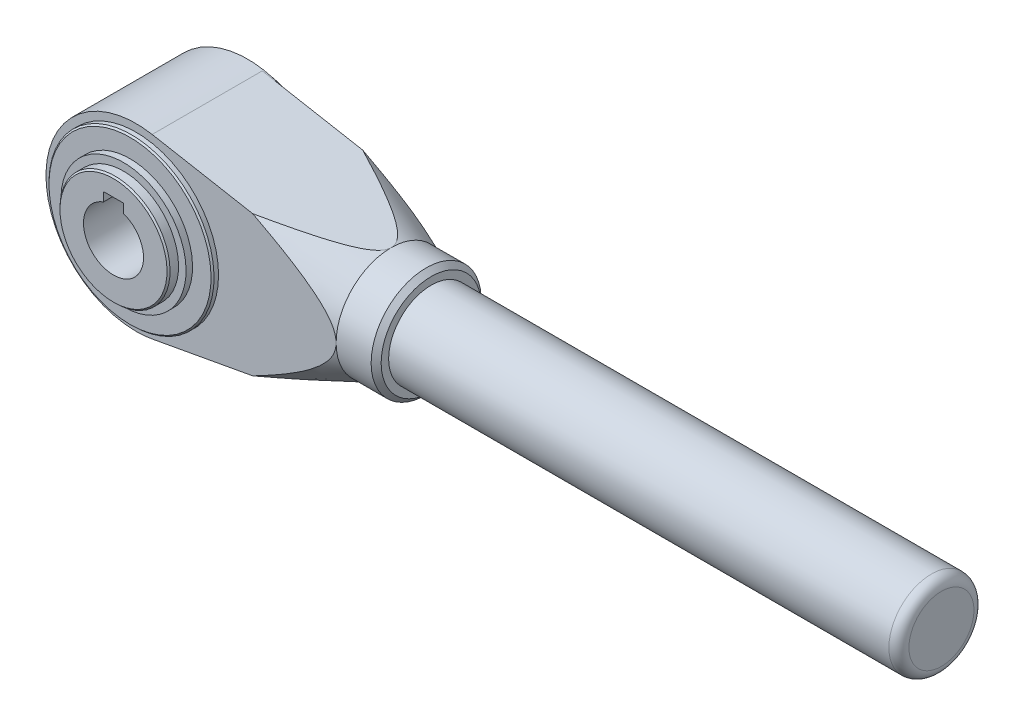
ISO-10303-21;
HEADER;
FILE_DESCRIPTION(('STEP AP214'),'2;1');
FILE_NAME('part.step','',(''),(''),'','','');
FILE_SCHEMA(('AUTOMOTIVE_DESIGN { 1 0 10303 214 1 1 1 1 }'));
ENDSEC;
DATA;
#1=APPLICATION_CONTEXT('core data for automotive mechanical design processes');
#2=APPLICATION_PROTOCOL_DEFINITION('international standard','automotive_design',2000,#1);
#3=PRODUCT_CONTEXT('',#1,'mechanical');
#4=PRODUCT('Part','Part','',(#3));
#5=PRODUCT_RELATED_PRODUCT_CATEGORY('part','',(#4));
#6=PRODUCT_DEFINITION_FORMATION('','',#4);
#7=PRODUCT_DEFINITION_CONTEXT('part definition',#1,'design');
#8=PRODUCT_DEFINITION('design','',#6,#7);
#9=PRODUCT_DEFINITION_SHAPE('','',#8);
#10=(LENGTH_UNIT() NAMED_UNIT(*) SI_UNIT(.MILLI.,.METRE.));
#11=(NAMED_UNIT(*) PLANE_ANGLE_UNIT() SI_UNIT($,.RADIAN.));
#12=(NAMED_UNIT(*) SI_UNIT($,.STERADIAN.) SOLID_ANGLE_UNIT());
#13=UNCERTAINTY_MEASURE_WITH_UNIT(LENGTH_MEASURE(1.E-05),#10,'distance_accuracy_value','');
#14=(GEOMETRIC_REPRESENTATION_CONTEXT(3) GLOBAL_UNCERTAINTY_ASSIGNED_CONTEXT((#13)) GLOBAL_UNIT_ASSIGNED_CONTEXT((#10,
#11,#12)) REPRESENTATION_CONTEXT('',''));
#15=CARTESIAN_POINT('',(0.,0.,0.));
#16=DIRECTION('',(0.,0.,1.));
#17=DIRECTION('',(1.,0.,0.));
#18=AXIS2_PLACEMENT_3D('',#15,#16,#17);
#19=CARTESIAN_POINT('',(0.,0.,26.5));
#20=DIRECTION('',(0.,0.,1.));
#21=DIRECTION('',(1.,0.,0.));
#22=AXIS2_PLACEMENT_3D('',#19,#20,#21);
#23=PLANE('',#22);
#24=CARTESIAN_POINT('',(0.513656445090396,-24.863798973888,26.5));
#25=CARTESIAN_POINT('',(1.48623306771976,-24.4277603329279,26.5));
#26=CARTESIAN_POINT('',(2.45813185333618,-23.9902030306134,26.5));
#27=CARTESIAN_POINT('',(4.40028248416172,-23.1114157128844,26.5));
#28=CARTESIAN_POINT('',(5.37053430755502,-22.6701856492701,26.5));
#29=CARTESIAN_POINT('',(7.30962383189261,-21.7831774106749,26.5));
#30=CARTESIAN_POINT('',(8.27846041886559,-21.3373967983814,26.5));
#31=CARTESIAN_POINT('',(10.2137484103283,-20.4406960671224,26.5));
#32=CARTESIAN_POINT('',(11.1801998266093,-19.9897759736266,26.5));
#33=CARTESIAN_POINT('',(13.1160037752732,-19.0789858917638,26.5));
#34=CARTESIAN_POINT('',(14.0853386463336,-18.6190783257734,26.5));
#35=CARTESIAN_POINT('',(16.0203090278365,-17.6915467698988,26.5));
#36=CARTESIAN_POINT('',(16.9859445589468,-17.2239228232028,26.5));
#37=CARTESIAN_POINT('',(18.9121964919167,-16.2791676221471,26.5));
#38=CARTESIAN_POINT('',(19.8728143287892,-15.8020392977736,26.5));
#39=CARTESIAN_POINT('',(21.7878448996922,-14.8354970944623,26.5));
#40=CARTESIAN_POINT('',(22.7422577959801,-14.3460835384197,26.5));
#41=CARTESIAN_POINT('',(24.1664666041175,-13.6003948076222,26.5));
#42=CARTESIAN_POINT('',(24.6394421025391,-13.3501905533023,26.5));
#43=CARTESIAN_POINT('',(25.5828831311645,-12.8450950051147,26.5));
#44=CARTESIAN_POINT('',(26.0533486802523,-12.5902037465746,26.5));
#45=CARTESIAN_POINT('',(26.9914945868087,-12.0748230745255,26.5));
#46=CARTESIAN_POINT('',(27.45917353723,-11.8143310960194,26.5));
#47=CARTESIAN_POINT('',(28.390860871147,-11.2868662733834,26.5));
#48=CARTESIAN_POINT('',(28.8548693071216,-11.0198935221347,26.5));
#49=CARTESIAN_POINT('',(29.7792413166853,-10.4776603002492,26.5));
#50=CARTESIAN_POINT('',(30.2395960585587,-10.202384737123,26.5));
#51=CARTESIAN_POINT('',(31.1545148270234,-9.64238023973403,26.5));
#52=CARTESIAN_POINT('',(31.6090790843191,-9.35765168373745,26.5));
#53=CARTESIAN_POINT('',(32.5103596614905,-8.77672546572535,26.5));
#54=CARTESIAN_POINT('',(32.9570816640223,-8.48053665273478,26.5));
#55=CARTESIAN_POINT('',(33.8404279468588,-7.8735202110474,26.5));
#56=CARTESIAN_POINT('',(34.2770540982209,-7.56269532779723,26.5));
#57=CARTESIAN_POINT('',(35.0610877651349,-6.97816245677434,26.5));
#58=CARTESIAN_POINT('',(35.4107395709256,-6.70747497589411,26.5));
#59=CARTESIAN_POINT('',(36.097283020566,-6.14968228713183,26.5));
#60=CARTESIAN_POINT('',(36.4341656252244,-5.86256579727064,26.5));
#61=CARTESIAN_POINT('',(36.9244942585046,-5.41723421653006,26.5));
#62=CARTESIAN_POINT('',(37.0850058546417,-5.26679257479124,26.5));
#63=CARTESIAN_POINT('',(37.4003600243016,-4.96009668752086,26.5));
#64=CARTESIAN_POINT('',(37.5552034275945,-4.80384329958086,26.5));
#65=CARTESIAN_POINT('',(37.8577792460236,-4.48492008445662,26.5));
#66=CARTESIAN_POINT('',(38.0055198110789,-4.32225802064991,26.5));
#67=CARTESIAN_POINT('',(38.2923601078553,-3.98952345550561,26.5));
#68=CARTESIAN_POINT('',(38.4314628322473,-3.81945355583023,26.5));
#69=CARTESIAN_POINT('',(38.6637883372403,-3.51665327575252,26.5));
#70=CARTESIAN_POINT('',(38.7594801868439,-3.38581979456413,26.5));
#71=CARTESIAN_POINT('',(38.9438379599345,-3.11926479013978,26.5));
#72=CARTESIAN_POINT('',(39.0325038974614,-2.98354327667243,26.5));
#73=CARTESIAN_POINT('',(39.201525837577,-2.7068250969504,26.5));
#74=CARTESIAN_POINT('',(39.2818744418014,-2.56582388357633,26.5));
#75=CARTESIAN_POINT('',(39.4325691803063,-2.27852997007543,26.5));
#76=CARTESIAN_POINT('',(39.5029150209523,-2.13223711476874,26.5));
#77=CARTESIAN_POINT('',(39.6328363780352,-1.83205578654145,26.5));
#78=CARTESIAN_POINT('',(39.6922174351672,-1.67808232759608,26.5));
#79=CARTESIAN_POINT('',(39.7967309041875,-1.36538503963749,26.5));
#80=CARTESIAN_POINT('',(39.841868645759,-1.20666301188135,26.5));
#81=CARTESIAN_POINT('',(39.915940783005,-0.88587228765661,26.5));
#82=CARTESIAN_POINT('',(39.9449169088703,-0.723813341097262,26.5));
#83=CARTESIAN_POINT('',(39.9854231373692,-0.397526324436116,26.5));
#84=CARTESIAN_POINT('',(39.9969570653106,-0.233298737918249,26.5));
#85=CARTESIAN_POINT('',(40.0016442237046,0.0728921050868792,26.5));
#86=CARTESIAN_POINT('',(39.9970983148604,0.214824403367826,26.5));
#87=CARTESIAN_POINT('',(39.9747707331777,0.497624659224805,26.5));
#88=CARTESIAN_POINT('',(39.9569903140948,0.638492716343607,26.5));
#89=CARTESIAN_POINT('',(39.9088362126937,0.918223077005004,26.5));
#90=CARTESIAN_POINT('',(39.8784470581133,1.05708269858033,26.5));
#91=CARTESIAN_POINT('',(39.8061220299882,1.33179598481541,26.5));
#92=CARTESIAN_POINT('',(39.7641788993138,1.4676477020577,26.5));
#93=CARTESIAN_POINT('',(39.5911955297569,1.95974973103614,26.5));
#94=CARTESIAN_POINT('',(39.4283557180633,2.30510922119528,26.5));
#95=CARTESIAN_POINT('',(39.1467363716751,2.80079252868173,26.5));
#96=CARTESIAN_POINT('',(39.0464570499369,2.96252128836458,26.5));
#97=CARTESIAN_POINT('',(38.8356151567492,3.2791906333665,26.5));
#98=CARTESIAN_POINT('',(38.7250539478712,3.43413211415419,26.5));
#99=CARTESIAN_POINT('',(38.4593164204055,3.78565994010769,26.5));
#100=CARTESIAN_POINT('',(38.3010886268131,3.9799193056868,26.5));
#101=CARTESIAN_POINT('',(37.9734819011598,4.35886275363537,26.5));
#102=CARTESIAN_POINT('',(37.8040979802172,4.54354248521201,26.5));
#103=CARTESIAN_POINT('',(37.4563737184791,4.9048080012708,26.5));
#104=CARTESIAN_POINT('',(37.2780189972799,5.08137986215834,26.5));
#105=CARTESIAN_POINT('',(36.9143878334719,5.42725584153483,26.5));
#106=CARTESIAN_POINT('',(36.7291105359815,5.59655905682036,26.5));
#107=CARTESIAN_POINT('',(36.3516801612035,5.93000132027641,26.5));
#108=CARTESIAN_POINT('',(36.1594881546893,6.09409613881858,26.5));
#109=CARTESIAN_POINT('',(35.7704869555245,6.41671299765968,26.5));
#110=CARTESIAN_POINT('',(35.5736776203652,6.57523486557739,26.5));
#111=CARTESIAN_POINT('',(35.1764633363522,6.88722584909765,26.5));
#112=CARTESIAN_POINT('',(34.9760627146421,7.04070048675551,26.5));
#113=CARTESIAN_POINT('',(34.5720670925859,7.34335910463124,26.5));
#114=CARTESIAN_POINT('',(34.3684722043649,7.49254323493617,26.5));
#115=CARTESIAN_POINT('',(33.7120082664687,7.9643636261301,26.5));
#116=CARTESIAN_POINT('',(33.253922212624,8.27975026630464,26.5));
#117=CARTESIAN_POINT('',(32.3282966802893,8.89638144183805,26.5));
#118=CARTESIAN_POINT('',(31.8607555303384,9.19762344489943,26.5));
#119=CARTESIAN_POINT('',(30.9183193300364,9.78899349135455,26.5));
#120=CARTESIAN_POINT('',(30.443419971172,10.0791146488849,26.5));
#121=CARTESIAN_POINT('',(29.4881911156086,10.6501709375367,26.5));
#122=CARTESIAN_POINT('',(29.0078619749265,10.9311066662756,26.5));
#123=CARTESIAN_POINT('',(28.0417528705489,11.4860668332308,26.5));
#124=CARTESIAN_POINT('',(27.5559628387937,11.7600737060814,26.5));
#125=CARTESIAN_POINT('',(26.5808590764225,12.30174828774,26.5));
#126=CARTESIAN_POINT('',(26.0915452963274,12.5694159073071,26.5));
#127=CARTESIAN_POINT('',(25.1101932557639,13.0992960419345,26.5));
#128=CARTESIAN_POINT('',(24.6181559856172,13.3615103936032,26.5));
#129=CARTESIAN_POINT('',(23.6316621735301,13.8813519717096,26.5));
#130=CARTESIAN_POINT('',(23.1372056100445,14.1389791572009,26.5));
#131=CARTESIAN_POINT('',(21.6508177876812,14.9059365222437,26.5));
#132=CARTESIAN_POINT('',(20.6558374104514,15.4093591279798,26.5));
#133=CARTESIAN_POINT('',(18.6598461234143,16.4042516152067,26.5));
#134=CARTESIAN_POINT('',(17.6588347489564,16.8957205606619,26.5));
#135=CARTESIAN_POINT('',(15.6536514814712,17.8685701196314,26.5));
#136=CARTESIAN_POINT('',(14.6494859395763,18.3499638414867,26.5));
#137=CARTESIAN_POINT('',(12.6376229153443,19.3052299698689,26.5));
#138=CARTESIAN_POINT('',(11.6299255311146,19.7791025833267,26.5));
#139=CARTESIAN_POINT('',(9.83623429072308,20.6159590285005,26.5));
#140=CARTESIAN_POINT('',(9.05080448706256,20.9801534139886,26.5));
#141=CARTESIAN_POINT('',(7.47847125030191,21.7053480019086,26.5));
#142=CARTESIAN_POINT('',(6.69156781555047,22.0663482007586,26.5));
#143=CARTESIAN_POINT('',(4.32895688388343,23.1452147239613,26.5));
#144=CARTESIAN_POINT('',(2.75135912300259,23.8589421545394,26.5));
#145=CARTESIAN_POINT('',(-0.407694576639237,25.277949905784,26.5));
#146=CARTESIAN_POINT('',(-1.9891506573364,25.9832299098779,26.5));
#147=CARTESIAN_POINT('',(-5.15502848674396,27.3871057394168,26.5));
#148=CARTESIAN_POINT('',(-6.73945024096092,28.085701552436,26.5));
#149=CARTESIAN_POINT('',(-9.91181701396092,29.4780396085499,26.5));
#150=CARTESIAN_POINT('',(-11.499763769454,30.1717778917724,26.5));
#151=CARTESIAN_POINT('',(-14.6775666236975,31.5548687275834,26.5));
#152=CARTESIAN_POINT('',(-16.2674227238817,32.2442212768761,26.5));
#153=CARTESIAN_POINT('',(-19.4486689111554,33.6192848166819,26.5));
#154=CARTESIAN_POINT('',(-21.0400589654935,34.3049958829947,26.5));
#155=CARTESIAN_POINT('',(-24.2241457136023,35.6733777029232,26.5));
#156=CARTESIAN_POINT('',(-25.816842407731,36.3560484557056,26.5));
#157=CARTESIAN_POINT('',(-30.5374637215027,38.3749456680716,26.5));
#158=CARTESIAN_POINT('',(-33.6669483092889,39.7075246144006,26.5));
#159=CARTESIAN_POINT('',(-39.9290155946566,42.3654336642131,26.5));
#160=CARTESIAN_POINT('',(-43.0615983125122,43.6907637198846,26.5));
#161=CARTESIAN_POINT('',(-49.3261870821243,46.334659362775,26.5));
#162=CARTESIAN_POINT('',(-52.458190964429,47.6532300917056,26.5));
#163=CARTESIAN_POINT('',(-57.1575405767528,49.6278479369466,26.5));
#164=CARTESIAN_POINT('',(-58.7242075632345,50.2855113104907,26.5));
#165=CARTESIAN_POINT('',(-61.8579460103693,51.5998729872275,26.5));
#166=CARTESIAN_POINT('',(-63.4250174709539,52.2565712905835,26.5));
#167=CARTESIAN_POINT('',(-64.9922674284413,52.9128433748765,26.5));
#168=B_SPLINE_CURVE_WITH_KNOTS('',3,(#24,#25,#26,#27,#28,#29,#30,#31,#32,#33,#34,#35,#36,#37,
#38,#39,#40,#41,#42,#43,#44,#45,#46,#47,#48,#49,#50,#51,#52,#53,#54,#55,#56,#57,#58,#59,#60,#61,
#62,#63,#64,#65,#66,#67,#68,#69,#70,#71,#72,#73,#74,#75,#76,#77,#78,#79,#80,#81,#82,#83,#84,#85,
#86,#87,#88,#89,#90,#91,#92,#93,#94,#95,#96,#97,#98,#99,#100,#101,#102,#103,#104,#105,#106,#107,
#108,#109,#110,#111,#112,#113,#114,#115,#116,#117,#118,#119,#120,#121,#122,#123,#124,#125,#126,
#127,#128,#129,#130,#131,#132,#133,#134,#135,#136,#137,#138,#139,#140,#141,#142,#143,#144,#145,
#146,#147,#148,#149,#150,#151,#152,#153,#154,#155,#156,#157,#158,#159,#160,#161,#162,#163,#164,
#165,#166,#167),.UNSPECIFIED.,.F.,.F.,(4,2,2,2,2,2,2,2,2,2,2,2,2,2,2,2,2,2,2,2,2,2,2,2,2,2,2,2,
2,2,2,2,2,2,2,2,2,2,2,2,2,2,2,2,2,2,2,2,2,2,2,2,2,2,2,2,2,2,2,2,2,2,2,2,2,2,2,2,2,2,2,4),(0.,
3.19755108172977,6.39514419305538,9.59455064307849,12.7939412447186,16.0126292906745,
19.231299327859,22.4489920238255,25.6666002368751,27.2718121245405,28.8770119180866,
30.4829632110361,32.0888915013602,33.6979395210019,35.3069232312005,36.9146884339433,
38.5221532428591,39.8483800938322,41.175528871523,41.8353891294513,42.4951524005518,
43.154139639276,43.8128972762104,44.2989895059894,44.7850807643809,45.2716007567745,
45.7581350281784,46.2526077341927,46.7468951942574,47.2399003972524,47.7327974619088,
48.1581940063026,48.5835502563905,49.0094300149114,49.4355778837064,50.5735380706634,
51.1442424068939,51.7148712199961,52.4659699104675,53.2174067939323,53.9700892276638,
54.7228649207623,55.4808885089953,56.2389355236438,56.9961235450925,57.7532850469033,
59.42136048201,61.089733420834,62.7591232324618,64.4284042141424,66.1015618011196,
67.7747429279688,69.44735110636,71.1199742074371,74.4651149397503,77.8105167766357,
81.151255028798,84.491901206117,87.0891686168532,89.6864389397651,94.8810138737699,
100.075782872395,105.270561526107,110.469171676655,115.667785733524,120.866291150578,
126.064797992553,136.268947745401,146.473164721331,156.667898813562,161.765221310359,
166.862542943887),.UNSPECIFIED.);
#169=CARTESIAN_POINT('',(23.3205451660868,14.042776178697,26.5));
#170=VERTEX_POINT('',#169);
#171=CARTESIAN_POINT('',(40.,0.,26.5));
#172=VERTEX_POINT('',#171);
#173=EDGE_CURVE('E231',#170,#172,#168,.F.);
#174=ORIENTED_EDGE('',*,*,#173,.F.);
#175=DIRECTION('',(-0.983764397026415,0.179464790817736,0.));
#176=VECTOR('',#175,1.);
#177=CARTESIAN_POINT('',(40.,11.,26.5));
#178=LINE('',#177,#176);
#179=CARTESIAN_POINT('',(3.23036623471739,17.707759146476,26.5));
#180=VERTEX_POINT('',#179);
#181=EDGE_CURVE('E303',#170,#180,#178,.T.);
#182=ORIENTED_EDGE('',*,*,#181,.T.);
#183=CARTESIAN_POINT('',(0.,0.,26.5));
#184=DIRECTION('',(0.,0.,1.));
#185=DIRECTION('',(1.,0.,0.));
#186=AXIS2_PLACEMENT_3D('',#183,#184,#185);
#187=CIRCLE('',#186,18.);
#188=CARTESIAN_POINT('',(3.23036623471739,-17.707759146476,26.5));
#189=VERTEX_POINT('',#188);
#190=EDGE_CURVE('E306',#180,#189,#187,.T.);
#191=ORIENTED_EDGE('',*,*,#190,.T.);
#192=DIRECTION('',(-0.983764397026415,-0.179464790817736,0.));
#193=VECTOR('',#192,1.);
#194=CARTESIAN_POINT('',(40.,-11.,26.5));
#195=LINE('',#194,#193);
#196=CARTESIAN_POINT('',(23.3205451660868,-14.042776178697,26.5));
#197=VERTEX_POINT('',#196);
#198=EDGE_CURVE('E310',#197,#189,#195,.T.);
#199=ORIENTED_EDGE('',*,*,#198,.F.);
#200=EDGE_CURVE('E192',#172,#197,#168,.F.);
#201=ORIENTED_EDGE('',*,*,#200,.F.);
#202=EDGE_LOOP('',(#174,#182,#191,#199,#201));
#203=FACE_BOUND('',#202,.T.);
#204=CARTESIAN_POINT('',(0.,0.,26.5));
#205=DIRECTION('',(0.,0.,1.));
#206=DIRECTION('',(1.,0.,0.));
#207=AXIS2_PLACEMENT_3D('',#204,#205,#206);
#208=CIRCLE('',#207,16.5);
#209=CARTESIAN_POINT('',(16.5,0.,26.5));
#210=VERTEX_POINT('',#209);
#211=EDGE_CURVE('E296',#210,#210,#208,.F.);
#212=ORIENTED_EDGE('',*,*,#211,.T.);
#213=EDGE_LOOP('',(#212));
#214=FACE_BOUND('',#213,.T.);
#215=ADVANCED_FACE('F15',(#203,#214),#23,.T.);
#216=CARTESIAN_POINT('',(0.,0.,4.5));
#217=DIRECTION('',(0.,0.,1.));
#218=DIRECTION('',(1.,0.,0.));
#219=AXIS2_PLACEMENT_3D('',#216,#217,#218);
#220=PLANE('',#219);
#221=DIRECTION('',(-0.983764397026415,0.179464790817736,0.));
#222=VECTOR('',#221,1.);
#223=CARTESIAN_POINT('',(40.,11.,4.5));
#224=LINE('',#223,#222);
#225=CARTESIAN_POINT('',(23.3205451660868,14.042776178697,4.5));
#226=VERTEX_POINT('',#225);
#227=CARTESIAN_POINT('',(3.23036623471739,17.707759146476,4.5));
#228=VERTEX_POINT('',#227);
#229=EDGE_CURVE('E297',#226,#228,#224,.T.);
#230=ORIENTED_EDGE('',*,*,#229,.F.);
#231=CARTESIAN_POINT('',(0.658369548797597,-24.798909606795,4.5));
#232=CARTESIAN_POINT('',(1.62844412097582,-24.3638060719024,4.5));
#233=CARTESIAN_POINT('',(2.59783886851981,-23.9271800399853,4.5));
#234=CARTESIAN_POINT('',(4.53497644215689,-23.0502456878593,4.5));
#235=CARTESIAN_POINT('',(5.50271924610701,-22.6099373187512,4.5));
#236=CARTESIAN_POINT('',(7.43679148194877,-21.724757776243,4.5));
#237=CARTESIAN_POINT('',(8.4031197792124,-21.2798841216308,4.5));
#238=CARTESIAN_POINT('',(10.3333832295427,-20.3849832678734,4.5));
#239=CARTESIAN_POINT('',(11.297318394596,-19.9349560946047,4.5));
#240=CARTESIAN_POINT('',(13.2287823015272,-19.0256017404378,4.5));
#241=CARTESIAN_POINT('',(14.1962911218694,-18.5662322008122,4.5));
#242=CARTESIAN_POINT('',(16.1275896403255,-17.639741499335,4.5));
#243=CARTESIAN_POINT('',(17.0913793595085,-17.1726203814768,4.5));
#244=CARTESIAN_POINT('',(19.0139079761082,-16.2288258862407,4.5));
#245=CARTESIAN_POINT('',(19.9726483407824,-15.7521555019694,4.5));
#246=CARTESIAN_POINT('',(21.8838843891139,-14.7864645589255,4.5));
#247=CARTESIAN_POINT('',(22.8363802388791,-14.297444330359,4.5));
#248=CARTESIAN_POINT('',(24.2575910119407,-13.552316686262,4.5));
#249=CARTESIAN_POINT('',(24.7295085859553,-13.3023159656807,4.5));
#250=CARTESIAN_POINT('',(25.6708155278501,-12.7976005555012,4.5));
#251=CARTESIAN_POINT('',(26.1402049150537,-12.5428859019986,4.5));
#252=CARTESIAN_POINT('',(27.07617870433,-12.0278230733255,4.5));
#253=CARTESIAN_POINT('',(27.5427616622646,-11.7674722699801,4.5));
#254=CARTESIAN_POINT('',(28.4722261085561,-11.2402480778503,4.5));
#255=CARTESIAN_POINT('',(28.9351076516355,-10.9733747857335,4.5));
#256=CARTESIAN_POINT('',(29.8570295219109,-10.4313770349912,4.5));
#257=CARTESIAN_POINT('',(30.3160624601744,-10.1562399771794,4.5));
#258=CARTESIAN_POINT('',(31.2282841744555,-9.5964498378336,4.5));
#259=CARTESIAN_POINT('',(31.6814731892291,-9.31179714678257,4.5));
#260=CARTESIAN_POINT('',(32.5799244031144,-8.73094140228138,4.5));
#261=CARTESIAN_POINT('',(33.025192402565,-8.43474735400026,4.5));
#262=CARTESIAN_POINT('',(33.9055165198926,-7.8276091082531,4.5));
#263=CARTESIAN_POINT('',(34.3405745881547,-7.51666776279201,4.5));
#264=CARTESIAN_POINT('',(35.1160203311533,-6.93594299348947,4.5));
#265=CARTESIAN_POINT('',(35.45883279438,-6.6694080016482,4.5));
#266=CARTESIAN_POINT('',(36.1319676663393,-6.12035836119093,4.5));
#267=CARTESIAN_POINT('',(36.4622817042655,-5.83783330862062,4.5));
#268=CARTESIAN_POINT('',(36.9431968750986,-5.3998085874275,4.5));
#269=CARTESIAN_POINT('',(37.1006695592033,-5.25184667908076,4.5));
#270=CARTESIAN_POINT('',(37.4101160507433,-4.95029557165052,4.5));
#271=CARTESIAN_POINT('',(37.5620906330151,-4.79670717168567,4.5));
#272=CARTESIAN_POINT('',(37.8591707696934,-4.48332689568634,4.5));
#273=CARTESIAN_POINT('',(38.0042838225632,-4.32354215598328,4.5));
#274=CARTESIAN_POINT('',(38.2861899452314,-3.99682659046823,4.5));
#275=CARTESIAN_POINT('',(38.4229856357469,-3.82989804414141,4.5));
#276=CARTESIAN_POINT('',(38.6533683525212,-3.53064636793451,4.5));
#277=CARTESIAN_POINT('',(38.7492244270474,-3.40007265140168,4.5));
#278=CARTESIAN_POINT('',(38.9339647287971,-3.13405608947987,4.5));
#279=CARTESIAN_POINT('',(39.0228489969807,-2.99861327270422,4.5));
#280=CARTESIAN_POINT('',(39.1923657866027,-2.7224811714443,4.5));
#281=CARTESIAN_POINT('',(39.2729917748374,-2.58178785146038,4.5));
#282=CARTESIAN_POINT('',(39.424341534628,-2.2950818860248,4.5));
#283=CARTESIAN_POINT('',(39.4950624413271,-2.14906771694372,4.5));
#284=CARTESIAN_POINT('',(39.6258204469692,-1.84945527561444,4.5));
#285=CARTESIAN_POINT('',(39.6856654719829,-1.69577236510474,4.5));
#286=CARTESIAN_POINT('',(39.791184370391,-1.38368212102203,4.5));
#287=CARTESIAN_POINT('',(39.8368679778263,-1.225278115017,4.5));
#288=CARTESIAN_POINT('',(39.912133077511,-0.905056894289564,4.5));
#289=CARTESIAN_POINT('',(39.9417538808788,-0.743249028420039,4.5));
#290=CARTESIAN_POINT('',(39.9836204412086,-0.417396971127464,4.5));
#291=CARTESIAN_POINT('',(39.9958700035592,-0.253353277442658,4.5));
#292=CARTESIAN_POINT('',(40.0019337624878,0.0531225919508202,4.5));
#293=CARTESIAN_POINT('',(39.9979921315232,0.195514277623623,4.5));
#294=CARTESIAN_POINT('',(39.9767711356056,0.479281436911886,4.5));
#295=CARTESIAN_POINT('',(39.9594929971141,0.620657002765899,4.5));
#296=CARTESIAN_POINT('',(39.9122290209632,0.901432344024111,4.5));
#297=CARTESIAN_POINT('',(39.8822275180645,1.04082946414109,4.5));
#298=CARTESIAN_POINT('',(39.8105615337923,1.31662726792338,4.5));
#299=CARTESIAN_POINT('',(39.7688896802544,1.45302599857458,4.5));
#300=CARTESIAN_POINT('',(39.5976239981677,1.94446802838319,4.5));
#301=CARTESIAN_POINT('',(39.4364407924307,2.28878811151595,4.5));
#302=CARTESIAN_POINT('',(39.1573548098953,2.78307653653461,4.5));
#303=CARTESIAN_POINT('',(39.0579311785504,2.94436484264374,4.5));
#304=CARTESIAN_POINT('',(38.8488066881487,3.26019544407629,4.5));
#305=CARTESIAN_POINT('',(38.7391071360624,3.41473859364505,4.5));
#306=CARTESIAN_POINT('',(38.4761569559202,3.76432323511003,4.5));
#307=CARTESIAN_POINT('',(38.319930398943,3.95710660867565,4.5));
#308=CARTESIAN_POINT('',(37.9964190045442,4.33322599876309,4.5));
#309=CARTESIAN_POINT('',(37.8291292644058,4.51655776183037,4.5));
#310=CARTESIAN_POINT('',(37.4856570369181,4.87522124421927,4.5));
#311=CARTESIAN_POINT('',(37.3094603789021,5.05053931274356,4.5));
#312=CARTESIAN_POINT('',(36.9501829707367,5.39398314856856,4.5));
#313=CARTESIAN_POINT('',(36.7671013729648,5.5621080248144,4.5));
#314=CARTESIAN_POINT('',(36.3941041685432,5.89324213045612,4.5));
#315=CARTESIAN_POINT('',(36.2041498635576,6.05620760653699,4.5));
#316=CARTESIAN_POINT('',(35.8196406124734,6.37661180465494,4.5));
#317=CARTESIAN_POINT('',(35.6250855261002,6.53405035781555,4.5));
#318=CARTESIAN_POINT('',(35.2323863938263,6.84391356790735,4.5));
#319=CARTESIAN_POINT('',(35.0342466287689,6.9963436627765,4.5));
#320=CARTESIAN_POINT('',(34.6347799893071,7.29694204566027,4.5));
#321=CARTESIAN_POINT('',(34.4334532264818,7.44511048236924,4.5));
#322=CARTESIAN_POINT('',(33.7847727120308,7.91334537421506,4.5));
#323=CARTESIAN_POINT('',(33.3322261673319,8.22622693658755,4.5));
#324=CARTESIAN_POINT('',(32.4177068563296,8.83794612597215,4.5));
#325=CARTESIAN_POINT('',(31.9557324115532,9.13678122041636,4.5));
#326=CARTESIAN_POINT('',(31.0244452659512,9.72340376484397,4.5));
#327=CARTESIAN_POINT('',(30.5551282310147,10.0111843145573,4.5));
#328=CARTESIAN_POINT('',(29.611071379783,10.5776050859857,4.5));
#329=CARTESIAN_POINT('',(29.1363319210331,10.8562459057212,4.5));
#330=CARTESIAN_POINT('',(28.1814115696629,11.4066472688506,4.5));
#331=CARTESIAN_POINT('',(27.7012205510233,11.6783902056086,4.5));
#332=CARTESIAN_POINT('',(26.7373162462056,12.2155596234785,4.5));
#333=CARTESIAN_POINT('',(26.2536029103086,12.4809860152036,4.5));
#334=CARTESIAN_POINT('',(25.2834511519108,13.006400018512,4.5));
#335=CARTESIAN_POINT('',(24.7970137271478,13.2663894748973,4.5));
#336=CARTESIAN_POINT('',(23.8217188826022,13.7817929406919,4.5));
#337=CARTESIAN_POINT('',(23.3328614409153,14.0372069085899,4.5));
#338=CARTESIAN_POINT('',(21.8631340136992,14.797606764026,4.5));
#339=CARTESIAN_POINT('',(20.8792119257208,15.2966952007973,4.5));
#340=CARTESIAN_POINT('',(18.905329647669,16.2829317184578,4.5));
#341=CARTESIAN_POINT('',(17.915368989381,16.7700788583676,4.5));
#342=CARTESIAN_POINT('',(15.9322751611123,17.7342893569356,4.5));
#343=CARTESIAN_POINT('',(14.9391484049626,18.2113659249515,4.5));
#344=CARTESIAN_POINT('',(12.9493555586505,19.1579969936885,4.5));
#345=CARTESIAN_POINT('',(11.9526895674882,19.6275517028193,4.5));
#346=CARTESIAN_POINT('',(10.1806878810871,20.4557542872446,4.5));
#347=CARTESIAN_POINT('',(9.40592220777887,20.815623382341,4.5));
#348=CARTESIAN_POINT('',(7.85492074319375,21.532180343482,4.5));
#349=CARTESIAN_POINT('',(7.0786849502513,21.8888682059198,4.5));
#350=CARTESIAN_POINT('',(4.7480802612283,22.9548116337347,4.5));
#351=CARTESIAN_POINT('',(3.19182444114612,23.6599422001,4.5));
#352=CARTESIAN_POINT('',(0.0754573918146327,25.0617746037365,4.5));
#353=CARTESIAN_POINT('',(-1.48465398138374,25.7584761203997,4.5));
#354=CARTESIAN_POINT('',(-4.60784269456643,27.1452029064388,4.5));
#355=CARTESIAN_POINT('',(-6.17092004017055,27.8352281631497,4.5));
#356=CARTESIAN_POINT('',(-9.30059547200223,29.2104254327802,4.5));
#357=CARTESIAN_POINT('',(-10.867195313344,29.8955934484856,4.5));
#358=CARTESIAN_POINT('',(-14.002307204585,31.2615417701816,4.5));
#359=CARTESIAN_POINT('',(-15.5708192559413,31.9423220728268,4.5));
#360=CARTESIAN_POINT('',(-18.7093805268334,33.3002369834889,4.5));
#361=CARTESIAN_POINT('',(-20.2794297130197,33.977371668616,4.5));
#362=CARTESIAN_POINT('',(-23.4208381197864,35.3285955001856,4.5));
#363=CARTESIAN_POINT('',(-24.9921973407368,36.0026846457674,4.5));
#364=CARTESIAN_POINT('',(-29.6478964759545,37.9954163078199,4.5));
#365=CARTESIAN_POINT('',(-32.7337988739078,39.3104083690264,4.5));
#366=CARTESIAN_POINT('',(-38.9087109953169,41.9331269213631,4.5));
#367=CARTESIAN_POINT('',(-41.9977207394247,43.2408533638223,4.5));
#368=CARTESIAN_POINT('',(-48.1751784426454,45.8495259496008,4.5));
#369=CARTESIAN_POINT('',(-51.2636241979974,47.1504773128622,4.5));
#370=CARTESIAN_POINT('',(-55.8976425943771,49.098653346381,4.5));
#371=CARTESIAN_POINT('',(-57.4425334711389,49.7475006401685,4.5));
#372=CARTESIAN_POINT('',(-60.5327216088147,51.0442260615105,4.5));
#373=CARTESIAN_POINT('',(-62.0780188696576,51.6921041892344,4.5));
#374=CARTESIAN_POINT('',(-63.6234955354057,52.3395541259,4.5));
#375=B_SPLINE_CURVE_WITH_KNOTS('',3,(#231,#232,#233,#234,#235,#236,#237,#238,#239,#240,#241,
#242,#243,#244,#245,#246,#247,#248,#249,#250,#251,#252,#253,#254,#255,#256,#257,#258,#259,#260,
#261,#262,#263,#264,#265,#266,#267,#268,#269,#270,#271,#272,#273,#274,#275,#276,#277,#278,#279,
#280,#281,#282,#283,#284,#285,#286,#287,#288,#289,#290,#291,#292,#293,#294,#295,#296,#297,#298,
#299,#300,#301,#302,#303,#304,#305,#306,#307,#308,#309,#310,#311,#312,#313,#314,#315,#316,#317,
#318,#319,#320,#321,#322,#323,#324,#325,#326,#327,#328,#329,#330,#331,#332,#333,#334,#335,#336,
#337,#338,#339,#340,#341,#342,#343,#344,#345,#346,#347,#348,#349,#350,#351,#352,#353,#354,#355,
#356,#357,#358,#359,#360,#361,#362,#363,#364,#365,#366,#367,#368,#369,#370,#371,#372,#373,#374),
.UNSPECIFIED.,.F.,.F.,(4,2,2,2,2,2,2,2,2,2,2,2,2,2,2,2,2,2,2,2,2,2,2,2,2,2,2,2,2,2,2,2,2,2,2,2,
2,2,2,2,2,2,2,2,2,2,2,2,2,2,2,2,2,2,2,2,2,2,2,2,2,2,2,2,2,2,2,2,2,2,2,4),(0.,3.18955420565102,
6.37915083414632,9.57058397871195,12.7620011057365,15.975047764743,19.1880761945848,
22.4001128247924,25.6120636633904,27.214184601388,28.8162932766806,30.419165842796,
32.0220146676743,33.6274455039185,35.2328105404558,36.8369471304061,38.4407747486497,
39.7431630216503,41.0464086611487,41.6945352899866,42.3425702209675,42.9898797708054,
43.6369842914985,44.1227410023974,44.6084948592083,45.0946300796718,45.5809056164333,
46.0750751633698,46.5689042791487,47.06151931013,47.5540264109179,47.9807394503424,
48.4074132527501,48.834613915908,49.2620850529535,50.3951442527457,50.9633729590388,
51.5315294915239,52.2754132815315,53.0196289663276,53.7650684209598,54.5105999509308,
55.2613207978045,56.0120645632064,56.7619642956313,57.5118378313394,59.1619674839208,
60.8123935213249,62.463833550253,64.1151653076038,65.7703573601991,67.4255728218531,
69.0802172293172,70.7348766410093,74.0445462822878,77.354475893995,80.6597538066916,
83.9649399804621,86.5277254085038,89.0905137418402,94.216124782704,99.3419301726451,
104.467745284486,109.597377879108,114.727014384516,119.856541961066,124.986070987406,
135.04925571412,145.112507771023,155.166295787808,160.193145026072,165.21999338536),.UNSPECIFIED.);
#376=CARTESIAN_POINT('',(40.,0.,4.5));
#377=VERTEX_POINT('',#376);
#378=EDGE_CURVE('E191',#226,#377,#375,.F.);
#379=ORIENTED_EDGE('',*,*,#378,.T.);
#380=CARTESIAN_POINT('',(23.3205451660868,-14.042776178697,4.5));
#381=VERTEX_POINT('',#380);
#382=EDGE_CURVE('E182',#377,#381,#375,.F.);
#383=ORIENTED_EDGE('',*,*,#382,.T.);
#384=DIRECTION('',(-0.983764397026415,-0.179464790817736,0.));
#385=VECTOR('',#384,1.);
#386=CARTESIAN_POINT('',(40.,-11.,4.5));
#387=LINE('',#386,#385);
#388=CARTESIAN_POINT('',(3.2303662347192,-17.7077591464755,4.5));
#389=VERTEX_POINT('',#388);
#390=EDGE_CURVE('E300',#381,#389,#387,.T.);
#391=ORIENTED_EDGE('',*,*,#390,.T.);
#392=CARTESIAN_POINT('',(0.,0.,4.5));
#393=DIRECTION('',(0.,0.,1.));
#394=DIRECTION('',(1.,0.,0.));
#395=AXIS2_PLACEMENT_3D('',#392,#393,#394);
#396=CIRCLE('',#395,18.);
#397=EDGE_CURVE('E346',#228,#389,#396,.F.);
#398=ORIENTED_EDGE('',*,*,#397,.F.);
#399=EDGE_LOOP('',(#230,#379,#383,#391,#398));
#400=FACE_BOUND('',#399,.T.);
#401=ADVANCED_FACE('F203',(#400),#220,.F.);
#402=CARTESIAN_POINT('',(40.,11.,26.5));
#403=DIRECTION('',(-0.179464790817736,-0.983764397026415,0.));
#404=DIRECTION('',(0.983764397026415,-0.179464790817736,0.));
#405=AXIS2_PLACEMENT_3D('',#402,#403,#404);
#406=PLANE('',#405);
#407=ORIENTED_EDGE('',*,*,#181,.F.);
#408=CARTESIAN_POINT('',(23.3200821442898,14.0428606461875,26.5002));
#409=CARTESIAN_POINT('',(23.8013397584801,13.9550664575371,26.2922942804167));
#410=CARTESIAN_POINT('',(24.2820423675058,13.8673735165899,26.0830492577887));
#411=CARTESIAN_POINT('',(25.2420785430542,13.6922373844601,25.6612659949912));
#412=CARTESIAN_POINT('',(25.7214120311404,13.6047942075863,25.4487275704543));
#413=CARTESIAN_POINT('',(26.6794056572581,13.4300306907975,25.019313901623));
#414=CARTESIAN_POINT('',(27.158062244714,13.3427109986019,24.8024304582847));
#415=CARTESIAN_POINT('',(28.1132635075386,13.1684568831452,24.3639372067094));
#416=CARTESIAN_POINT('',(28.589808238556,13.0815224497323,24.1423275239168));
#417=CARTESIAN_POINT('',(29.5533985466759,12.9057379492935,23.6870757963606));
#418=CARTESIAN_POINT('',(30.0403696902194,12.8169014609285,23.4532704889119));
#419=CARTESIAN_POINT('',(31.0106255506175,12.6399009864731,22.9779036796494));
#420=CARTESIAN_POINT('',(31.4939103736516,12.5517369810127,22.7363424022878));
#421=CARTESIAN_POINT('',(32.4551137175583,12.3763879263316,22.243390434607));
#422=CARTESIAN_POINT('',(32.9330365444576,12.2892020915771,21.9920084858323));
#423=CARTESIAN_POINT('',(33.6445766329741,12.1593982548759,21.6048594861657));
#424=CARTESIAN_POINT('',(33.8808513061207,12.116295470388,21.4741389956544));
#425=CARTESIAN_POINT('',(34.3512259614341,12.0304866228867,21.2087212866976));
#426=CARTESIAN_POINT('',(34.5853260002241,11.9877805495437,21.0740241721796));
#427=CARTESIAN_POINT('',(35.0841804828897,11.8967762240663,20.7802782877));
#428=CARTESIAN_POINT('',(35.3485235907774,11.8485530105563,20.6205047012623));
#429=CARTESIAN_POINT('',(35.8726770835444,11.7529334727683,20.2932672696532));
#430=CARTESIAN_POINT('',(36.132486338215,11.7055373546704,20.1258015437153));
#431=CARTESIAN_POINT('',(36.644859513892,11.6120668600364,19.7818358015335));
#432=CARTESIAN_POINT('',(36.897447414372,11.5659881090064,19.605372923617));
#433=CARTESIAN_POINT('',(37.3937278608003,11.4754533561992,19.2400426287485));
#434=CARTESIAN_POINT('',(37.6374244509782,11.430996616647,19.0511809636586));
#435=CARTESIAN_POINT('',(38.0848119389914,11.3493812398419,18.6790891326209));
#436=CARTESIAN_POINT('',(38.289913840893,11.3119651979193,18.4976289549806));
#437=CARTESIAN_POINT('',(38.6846001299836,11.2399639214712,18.1171170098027));
#438=CARTESIAN_POINT('',(38.8741648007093,11.205382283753,17.9180435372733));
#439=CARTESIAN_POINT('',(39.1993800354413,11.1460543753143,17.5304554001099));
#440=CARTESIAN_POINT('',(39.338812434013,11.1206181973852,17.3452789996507));
#441=CARTESIAN_POINT('',(39.5884901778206,11.0750703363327,16.955488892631));
#442=CARTESIAN_POINT('',(39.6988321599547,11.0549410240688,16.7509426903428));
#443=CARTESIAN_POINT('',(39.8428069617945,11.0286761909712,16.3992471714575));
#444=CARTESIAN_POINT('',(39.8897582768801,11.0201110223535,16.257822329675));
#445=CARTESIAN_POINT('',(39.9601944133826,11.0072615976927,15.9690942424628));
#446=CARTESIAN_POINT('',(39.983718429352,11.0029701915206,15.8218012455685));
#447=CARTESIAN_POINT('',(40.0043051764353,10.9992146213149,15.52450548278));
#448=CARTESIAN_POINT('',(40.0012357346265,10.9997745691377,15.3744928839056));
#449=CARTESIAN_POINT('',(39.9687699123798,11.0056971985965,15.077393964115));
#450=CARTESIAN_POINT('',(39.9393425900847,11.0110655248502,14.9303112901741));
#451=CARTESIAN_POINT('',(39.8472264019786,11.0278699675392,14.6052948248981));
#452=CARTESIAN_POINT('',(39.7778473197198,11.0405265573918,14.4293632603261));
#453=CARTESIAN_POINT('',(39.6129170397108,11.0706142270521,14.0907650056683));
#454=CARTESIAN_POINT('',(39.517306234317,11.0880561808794,13.9281296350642));
#455=CARTESIAN_POINT('',(39.314487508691,11.1250557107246,13.6250963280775));
#456=CARTESIAN_POINT('',(39.2083399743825,11.1444198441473,13.4839473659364));
#457=CARTESIAN_POINT('',(38.9846756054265,11.1852221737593,13.2111880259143));
#458=CARTESIAN_POINT('',(38.8671475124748,11.2066624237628,13.0795873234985));
#459=CARTESIAN_POINT('',(38.6235164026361,11.2511072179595,12.82408743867));
#460=CARTESIAN_POINT('',(38.4973857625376,11.2741168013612,12.7002157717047));
#461=CARTESIAN_POINT('',(38.239079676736,11.3212387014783,12.4593608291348));
#462=CARTESIAN_POINT('',(38.1069073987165,11.345350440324,12.3423740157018));
#463=CARTESIAN_POINT('',(37.8360743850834,11.3947575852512,12.1125513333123));
#464=CARTESIAN_POINT('',(37.6973498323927,11.4200646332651,11.9997936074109));
#465=CARTESIAN_POINT('',(37.4161500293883,11.4713629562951,11.7792046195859));
#466=CARTESIAN_POINT('',(37.2736742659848,11.4973543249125,11.6713740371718));
#467=CARTESIAN_POINT('',(36.8416455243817,11.5761678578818,11.3540017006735));
#468=CARTESIAN_POINT('',(36.5476504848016,11.6298003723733,11.150711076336));
#469=CARTESIAN_POINT('',(35.9511715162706,11.7386140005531,10.7560267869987));
#470=CARTESIAN_POINT('',(35.6486694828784,11.7937984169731,10.5646618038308));
#471=CARTESIAN_POINT('',(35.0380272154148,11.905195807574,10.1914163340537));
#472=CARTESIAN_POINT('',(34.7298862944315,11.9614089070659,10.0095370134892));
#473=CARTESIAN_POINT('',(34.1077866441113,12.0748964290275,9.65229511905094));
#474=CARTESIAN_POINT('',(33.7938054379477,12.1321749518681,9.47697319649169));
#475=CARTESIAN_POINT('',(33.1626176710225,12.2473203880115,9.13239608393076));
#476=CARTESIAN_POINT('',(32.8454108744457,12.3051873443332,8.96314134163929));
#477=CARTESIAN_POINT('',(32.2089450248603,12.4212956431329,8.62985322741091));
#478=CARTESIAN_POINT('',(31.889689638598,12.4795363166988,8.46581260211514));
#479=CARTESIAN_POINT('',(31.2491554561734,12.5963867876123,8.14186595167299));
#480=CARTESIAN_POINT('',(30.9278766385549,12.6549965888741,7.98195997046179));
#481=CARTESIAN_POINT('',(30.002062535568,12.8238897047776,7.52732840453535));
#482=CARTESIAN_POINT('',(29.3954568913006,12.9345507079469,7.23695969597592));
#483=CARTESIAN_POINT('',(28.1778612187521,13.1566725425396,6.66519039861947));
#484=CARTESIAN_POINT('',(27.5668693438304,13.2681337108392,6.38379389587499));
#485=CARTESIAN_POINT('',(26.3510207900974,13.4899368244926,5.83223150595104));
#486=CARTESIAN_POINT('',(25.7462102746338,13.6002703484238,5.5619603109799));
#487=CARTESIAN_POINT('',(24.8374192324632,13.7660580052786,5.16070248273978));
#488=CARTESIAN_POINT('',(24.5343072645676,13.8213536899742,5.02767623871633));
#489=CARTESIAN_POINT('',(23.927567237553,13.9320392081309,4.76285088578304));
#490=CARTESIAN_POINT('',(23.6239391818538,13.987429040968,4.63105176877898));
#491=CARTESIAN_POINT('',(23.3200821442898,14.0428606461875,4.4998));
#492=B_SPLINE_CURVE_WITH_KNOTS('',3,(#408,#409,#410,#411,#412,#413,#414,#415,#416,#417,#418,
#419,#420,#421,#422,#423,#424,#425,#426,#427,#428,#429,#430,#431,#432,#433,#434,#435,#436,#437,
#438,#439,#440,#441,#442,#443,#444,#445,#446,#447,#448,#449,#450,#451,#452,#453,#454,#455,#456,
#457,#458,#459,#460,#461,#462,#463,#464,#465,#466,#467,#468,#469,#470,#471,#472,#473,#474,#475,
#476,#477,#478,#479,#480,#481,#482,#483,#484,#485,#486,#487,#488,#489,#490,#491),.UNSPECIFIED.,
.F.,.F.,(4,2,2,2,2,2,2,2,2,2,2,2,2,2,2,2,2,2,2,2,2,2,2,2,2,2,2,2,2,2,2,2,2,2,2,2,2,2,2,2,2,4),
(0.,1.59464387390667,3.18937734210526,4.78747319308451,6.38552667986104,8.02781195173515,
9.67004973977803,11.3108576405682,12.1311586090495,12.9514381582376,13.889193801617,
14.8271799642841,15.7615663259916,16.6955222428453,17.5240729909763,18.3536593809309,
19.051588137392,19.7471683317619,20.1932854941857,20.638655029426,21.0862393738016,
21.5343498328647,22.0997573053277,22.6664603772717,23.1986629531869,23.7313975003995,
24.2659315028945,24.8001883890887,25.3417149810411,25.8833160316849,26.9671435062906,
28.0534843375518,29.1399583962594,30.2323195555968,31.3247611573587,32.4156098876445,
33.5064702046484,35.5510504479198,37.5965488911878,39.6112447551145,40.6180566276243,
41.6248618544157),.UNSPECIFIED.);
#493=CARTESIAN_POINT('',(40.,11.,15.5));
#494=VERTEX_POINT('',#493);
#495=EDGE_CURVE('E230',#170,#494,#492,.T.);
#496=ORIENTED_EDGE('',*,*,#495,.T.);
#497=EDGE_CURVE('E222',#494,#226,#492,.T.);
#498=ORIENTED_EDGE('',*,*,#497,.T.);
#499=ORIENTED_EDGE('',*,*,#229,.T.);
#500=DIRECTION('',(0.,0.,-1.));
#501=VECTOR('',#500,1.);
#502=CARTESIAN_POINT('',(3.23036623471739,17.707759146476,26.5));
#503=LINE('',#502,#501);
#504=EDGE_CURVE('E317',#180,#228,#503,.T.);
#505=ORIENTED_EDGE('',*,*,#504,.F.);
#506=EDGE_LOOP('',(#407,#496,#498,#499,#505));
#507=FACE_BOUND('',#506,.T.);
#508=ADVANCED_FACE('F207',(#507),#406,.F.);
#509=CARTESIAN_POINT('',(0.,0.,26.5));
#510=DIRECTION('',(0.,0.,-1.));
#511=DIRECTION('',(-1.,0.,0.));
#512=AXIS2_PLACEMENT_3D('',#509,#510,#511);
#513=CYLINDRICAL_SURFACE('',#512,18.);
#514=ORIENTED_EDGE('',*,*,#504,.T.);
#515=ORIENTED_EDGE('',*,*,#397,.T.);
#516=DIRECTION('',(0.,0.,-1.));
#517=VECTOR('',#516,1.);
#518=CARTESIAN_POINT('',(3.23036623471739,-17.707759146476,26.5));
#519=LINE('',#518,#517);
#520=EDGE_CURVE('E313',#189,#389,#519,.T.);
#521=ORIENTED_EDGE('',*,*,#520,.F.);
#522=ORIENTED_EDGE('',*,*,#190,.F.);
#523=EDGE_LOOP('',(#514,#515,#521,#522));
#524=FACE_BOUND('',#523,.T.);
#525=CARTESIAN_POINT('',(0.,0.,4.1999999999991));
#526=DIRECTION('',(0.,0.,1.));
#527=DIRECTION('',(0.,-1.,0.));
#528=AXIS2_PLACEMENT_3D('',#525,#526,#527);
#529=CIRCLE('',#528,18.);
#530=CARTESIAN_POINT('',(0.,-18.,4.19999999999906));
#531=VERTEX_POINT('',#530);
#532=EDGE_CURVE('E232',#531,#531,#529,.T.);
#533=ORIENTED_EDGE('',*,*,#532,.T.);
#534=EDGE_LOOP('',(#533));
#535=FACE_BOUND('',#534,.T.);
#536=ADVANCED_FACE('F217',(#524,#535),#513,.T.);
#537=CARTESIAN_POINT('',(40.,-11.,26.5));
#538=DIRECTION('',(0.179464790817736,-0.983764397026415,0.));
#539=DIRECTION('',(0.983764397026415,0.179464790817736,0.));
#540=AXIS2_PLACEMENT_3D('',#537,#538,#539);
#541=PLANE('',#540);
#542=CARTESIAN_POINT('',(23.32008214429,-14.0428606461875,26.5002));
#543=CARTESIAN_POINT('',(23.8013397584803,-13.955066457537,26.2922942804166));
#544=CARTESIAN_POINT('',(24.2820423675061,-13.8673735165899,26.0830492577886));
#545=CARTESIAN_POINT('',(25.2420785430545,-13.69223738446,25.6612659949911));
#546=CARTESIAN_POINT('',(25.7214120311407,-13.6047942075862,25.4487275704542));
#547=CARTESIAN_POINT('',(26.6794056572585,-13.4300306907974,25.0193139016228));
#548=CARTESIAN_POINT('',(27.1580622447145,-13.3427109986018,24.8024304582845));
#549=CARTESIAN_POINT('',(28.1132635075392,-13.1684568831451,24.3639372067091));
#550=CARTESIAN_POINT('',(28.5898082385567,-13.0815224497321,24.1423275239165));
#551=CARTESIAN_POINT('',(29.5533985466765,-12.9057379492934,23.6870757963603));
#552=CARTESIAN_POINT('',(30.04036969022,-12.8169014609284,23.4532704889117));
#553=CARTESIAN_POINT('',(31.0106255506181,-12.639900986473,22.9779036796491));
#554=CARTESIAN_POINT('',(31.4939103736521,-12.5517369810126,22.7363424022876));
#555=CARTESIAN_POINT('',(32.4551137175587,-12.3763879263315,22.2433904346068));
#556=CARTESIAN_POINT('',(32.9330365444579,-12.289202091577,21.9920084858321));
#557=CARTESIAN_POINT('',(33.6445766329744,-12.1593982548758,21.6048594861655));
#558=CARTESIAN_POINT('',(33.880851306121,-12.1162954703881,21.4741389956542));
#559=CARTESIAN_POINT('',(34.3512259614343,-12.0304866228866,21.2087212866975));
#560=CARTESIAN_POINT('',(34.5853260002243,-11.9877805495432,21.0740241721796));
#561=CARTESIAN_POINT('',(35.0841804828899,-11.8967762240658,20.7802782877));
#562=CARTESIAN_POINT('',(35.3485235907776,-11.8485530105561,20.6205047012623));
#563=CARTESIAN_POINT('',(35.8726770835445,-11.7529334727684,20.293267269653));
#564=CARTESIAN_POINT('',(36.1324863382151,-11.7055373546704,20.1258015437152));
#565=CARTESIAN_POINT('',(36.6448595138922,-11.6120668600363,19.7818358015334));
#566=CARTESIAN_POINT('',(36.8974474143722,-11.5659881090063,19.6053729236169));
#567=CARTESIAN_POINT('',(37.3937278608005,-11.4754533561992,19.2400426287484));
#568=CARTESIAN_POINT('',(37.6374244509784,-11.430996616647,19.0511809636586));
#569=CARTESIAN_POINT('',(38.0848119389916,-11.3493812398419,18.6790891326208));
#570=CARTESIAN_POINT('',(38.2899138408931,-11.3119651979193,18.4976289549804));
#571=CARTESIAN_POINT('',(38.6846001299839,-11.2399639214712,18.1171170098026));
#572=CARTESIAN_POINT('',(38.8741648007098,-11.2053822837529,17.9180435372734));
#573=CARTESIAN_POINT('',(39.1993800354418,-11.1460543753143,17.53045540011));
#574=CARTESIAN_POINT('',(39.3388124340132,-11.1206181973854,17.3452789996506));
#575=CARTESIAN_POINT('',(39.5884901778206,-11.0750703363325,16.9554888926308));
#576=CARTESIAN_POINT('',(39.6988321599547,-11.0549410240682,16.7509426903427));
#577=CARTESIAN_POINT('',(39.8428069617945,-11.0286761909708,16.3992471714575));
#578=CARTESIAN_POINT('',(39.8897582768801,-11.0201110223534,16.257822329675));
#579=CARTESIAN_POINT('',(39.9601944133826,-11.0072615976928,15.9690942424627));
#580=CARTESIAN_POINT('',(39.983718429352,-11.0029701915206,15.8218012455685));
#581=CARTESIAN_POINT('',(40.0043051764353,-10.9992146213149,15.52450548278));
#582=CARTESIAN_POINT('',(40.0012357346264,-10.9997745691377,15.3744928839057));
#583=CARTESIAN_POINT('',(39.9687699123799,-11.0056971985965,15.077393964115));
#584=CARTESIAN_POINT('',(39.9393425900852,-11.0110655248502,14.9303112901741));
#585=CARTESIAN_POINT('',(39.8472264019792,-11.0278699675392,14.6052948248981));
#586=CARTESIAN_POINT('',(39.77784731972,-11.0405265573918,14.4293632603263));
#587=CARTESIAN_POINT('',(39.6129170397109,-11.0706142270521,14.0907650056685));
#588=CARTESIAN_POINT('',(39.5173062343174,-11.0880561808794,13.9281296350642));
#589=CARTESIAN_POINT('',(39.3144875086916,-11.1250557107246,13.6250963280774));
#590=CARTESIAN_POINT('',(39.2083399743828,-11.1444198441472,13.4839473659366));
#591=CARTESIAN_POINT('',(38.9846756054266,-11.1852221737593,13.2111880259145));
#592=CARTESIAN_POINT('',(38.8671475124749,-11.2066624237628,13.0795873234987));
#593=CARTESIAN_POINT('',(38.6235164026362,-11.2511072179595,12.8240874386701));
#594=CARTESIAN_POINT('',(38.4973857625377,-11.2741168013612,12.7002157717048));
#595=CARTESIAN_POINT('',(38.2390796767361,-11.3212387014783,12.4593608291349));
#596=CARTESIAN_POINT('',(38.1069073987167,-11.345350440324,12.3423740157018));
#597=CARTESIAN_POINT('',(37.8360743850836,-11.3947575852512,12.1125513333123));
#598=CARTESIAN_POINT('',(37.6973498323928,-11.420064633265,11.999793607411));
#599=CARTESIAN_POINT('',(37.4161500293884,-11.471362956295,11.7792046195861));
#600=CARTESIAN_POINT('',(37.273674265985,-11.4973543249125,11.6713740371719));
#601=CARTESIAN_POINT('',(36.8416455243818,-11.5761678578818,11.3540017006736));
#602=CARTESIAN_POINT('',(36.5476504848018,-11.6298003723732,11.1507110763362));
#603=CARTESIAN_POINT('',(35.9511715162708,-11.7386140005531,10.7560267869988));
#604=CARTESIAN_POINT('',(35.6486694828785,-11.7937984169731,10.5646618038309));
#605=CARTESIAN_POINT('',(35.0380272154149,-11.905195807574,10.1914163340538));
#606=CARTESIAN_POINT('',(34.7298862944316,-11.9614089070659,10.0095370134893));
#607=CARTESIAN_POINT('',(34.1077866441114,-12.0748964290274,9.65229511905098));
#608=CARTESIAN_POINT('',(33.7938054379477,-12.132174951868,9.47697319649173));
#609=CARTESIAN_POINT('',(33.1626176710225,-12.2473203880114,9.13239608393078));
#610=CARTESIAN_POINT('',(32.8454108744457,-12.3051873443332,8.96314134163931));
#611=CARTESIAN_POINT('',(32.2089450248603,-12.4212956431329,8.62985322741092));
#612=CARTESIAN_POINT('',(31.8896896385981,-12.4795363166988,8.46581260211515));
#613=CARTESIAN_POINT('',(31.2491554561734,-12.5963867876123,8.14186595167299));
#614=CARTESIAN_POINT('',(30.9278766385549,-12.6549965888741,7.98195997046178));
#615=CARTESIAN_POINT('',(30.002062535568,-12.8238897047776,7.52732840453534));
#616=CARTESIAN_POINT('',(29.3954568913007,-12.9345507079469,7.23695969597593));
#617=CARTESIAN_POINT('',(28.1778612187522,-13.1566725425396,6.6651903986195));
#618=CARTESIAN_POINT('',(27.5668693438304,-13.2681337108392,6.38379389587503));
#619=CARTESIAN_POINT('',(26.3510207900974,-13.4899368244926,5.83223150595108));
#620=CARTESIAN_POINT('',(25.7462102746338,-13.6002703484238,5.56196031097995));
#621=CARTESIAN_POINT('',(24.8374192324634,-13.7660580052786,5.16070248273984));
#622=CARTESIAN_POINT('',(24.5343072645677,-13.8213536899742,5.0276762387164));
#623=CARTESIAN_POINT('',(23.9275672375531,-13.9320392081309,4.7628508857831));
#624=CARTESIAN_POINT('',(23.623939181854,-13.987429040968,4.63105176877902));
#625=CARTESIAN_POINT('',(23.32008214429,-14.0428606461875,4.4998));
#626=B_SPLINE_CURVE_WITH_KNOTS('',3,(#542,#543,#544,#545,#546,#547,#548,#549,#550,#551,#552,
#553,#554,#555,#556,#557,#558,#559,#560,#561,#562,#563,#564,#565,#566,#567,#568,#569,#570,#571,
#572,#573,#574,#575,#576,#577,#578,#579,#580,#581,#582,#583,#584,#585,#586,#587,#588,#589,#590,
#591,#592,#593,#594,#595,#596,#597,#598,#599,#600,#601,#602,#603,#604,#605,#606,#607,#608,#609,
#610,#611,#612,#613,#614,#615,#616,#617,#618,#619,#620,#621,#622,#623,#624,#625),.UNSPECIFIED.,
.F.,.F.,(4,2,2,2,2,2,2,2,2,2,2,2,2,2,2,2,2,2,2,2,2,2,2,2,2,2,2,2,2,2,2,2,2,2,2,2,2,2,2,2,2,4),
(0.,1.5946438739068,3.18937734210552,4.78747319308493,6.38552667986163,8.02781195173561,
9.67004973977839,11.3108576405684,12.1311586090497,12.9514381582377,13.889193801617,
14.8271799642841,15.7615663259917,16.6955222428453,17.5240729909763,18.3536593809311,
19.051588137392,19.7471683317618,20.1932854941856,20.6386550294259,21.0862393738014,
21.5343498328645,22.0997573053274,22.6664603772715,23.1986629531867,23.7313975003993,
24.2659315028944,24.8001883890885,25.3417149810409,25.8833160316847,26.9671435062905,
28.0534843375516,29.1399583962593,30.2323195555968,31.3247611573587,32.4156098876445,
33.5064702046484,35.5510504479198,37.5965488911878,39.6112447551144,40.6180566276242,
41.6248618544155),.UNSPECIFIED.);
#627=CARTESIAN_POINT('',(40.,-11.,15.5));
#628=VERTEX_POINT('',#627);
#629=EDGE_CURVE('E9',#197,#628,#626,.T.);
#630=ORIENTED_EDGE('',*,*,#629,.F.);
#631=ORIENTED_EDGE('',*,*,#198,.T.);
#632=ORIENTED_EDGE('',*,*,#520,.T.);
#633=ORIENTED_EDGE('',*,*,#390,.F.);
#634=EDGE_CURVE('E19',#628,#381,#626,.T.);
#635=ORIENTED_EDGE('',*,*,#634,.F.);
#636=EDGE_LOOP('',(#630,#631,#632,#633,#635));
#637=FACE_BOUND('',#636,.T.);
#638=ADVANCED_FACE('F219',(#637),#541,.T.);
#639=CARTESIAN_POINT('',(-16.5,0.,4.19999999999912));
#640=DIRECTION('',(0.,0.,1.));
#641=DIRECTION('',(0.,-1.,0.));
#642=AXIS2_PLACEMENT_3D('',#639,#640,#641);
#643=PLANE('',#642);
#644=ORIENTED_EDGE('',*,*,#532,.F.);
#645=EDGE_LOOP('',(#644));
#646=FACE_BOUND('',#645,.T.);
#647=CARTESIAN_POINT('',(0.,0.,4.1999999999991));
#648=DIRECTION('',(0.,0.,1.));
#649=DIRECTION('',(0.,-1.,0.));
#650=AXIS2_PLACEMENT_3D('',#647,#648,#649);
#651=CIRCLE('',#650,16.5);
#652=CARTESIAN_POINT('',(0.,-16.5,4.19999999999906));
#653=VERTEX_POINT('',#652);
#654=EDGE_CURVE('E236',#653,#653,#651,.T.);
#655=ORIENTED_EDGE('',*,*,#654,.T.);
#656=EDGE_LOOP('',(#655));
#657=FACE_BOUND('',#656,.T.);
#658=ADVANCED_FACE('F420',(#646,#657),#643,.F.);
#659=CARTESIAN_POINT('',(0.,0.,36.1105563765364));
#660=DIRECTION('',(0.,0.,1.));
#661=DIRECTION('',(0.,-1.,0.));
#662=AXIS2_PLACEMENT_3D('',#659,#660,#661);
#663=CYLINDRICAL_SURFACE('',#662,16.5);
#664=CARTESIAN_POINT('',(0.,0.,3.));
#665=DIRECTION('',(0.,0.,1.));
#666=DIRECTION('',(0.,-1.,0.));
#667=AXIS2_PLACEMENT_3D('',#664,#665,#666);
#668=CIRCLE('',#667,16.5);
#669=CARTESIAN_POINT('',(0.,-16.5,2.99999999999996));
#670=VERTEX_POINT('',#669);
#671=EDGE_CURVE('E240',#670,#670,#668,.T.);
#672=ORIENTED_EDGE('',*,*,#671,.T.);
#673=EDGE_LOOP('',(#672));
#674=FACE_BOUND('',#673,.T.);
#675=ORIENTED_EDGE('',*,*,#654,.F.);
#676=EDGE_LOOP('',(#675));
#677=FACE_BOUND('',#676,.T.);
#678=ADVANCED_FACE('F417',(#674,#677),#663,.T.);
#679=CARTESIAN_POINT('',(0.,0.,3.));
#680=DIRECTION('',(0.,0.,1.));
#681=DIRECTION('',(0.,-1.,0.));
#682=AXIS2_PLACEMENT_3D('',#679,#680,#681);
#683=CONICAL_SURFACE('',#682,16.5,0.785398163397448);
#684=CARTESIAN_POINT('',(0.,0.,2.69999999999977));
#685=DIRECTION('',(0.,0.,1.));
#686=DIRECTION('',(0.,-1.,0.));
#687=AXIS2_PLACEMENT_3D('',#684,#685,#686);
#688=CIRCLE('',#687,16.1999999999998);
#689=CARTESIAN_POINT('',(0.,-16.1999999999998,2.69999999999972));
#690=VERTEX_POINT('',#689);
#691=EDGE_CURVE('E244',#690,#690,#688,.T.);
#692=ORIENTED_EDGE('',*,*,#691,.T.);
#693=EDGE_LOOP('',(#692));
#694=FACE_BOUND('',#693,.T.);
#695=ORIENTED_EDGE('',*,*,#671,.F.);
#696=EDGE_LOOP('',(#695));
#697=FACE_BOUND('',#696,.T.);
#698=ADVANCED_FACE('F413',(#694,#697),#683,.T.);
#699=CARTESIAN_POINT('',(-16.1999999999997,0.,2.69999999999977));
#700=DIRECTION('',(0.,0.,-1.));
#701=DIRECTION('',(0.,1.,0.));
#702=AXIS2_PLACEMENT_3D('',#699,#700,#701);
#703=PLANE('',#702);
#704=CARTESIAN_POINT('',(0.,0.,2.69999999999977));
#705=DIRECTION('',(0.,0.,1.));
#706=DIRECTION('',(0.,-1.,0.));
#707=AXIS2_PLACEMENT_3D('',#704,#705,#706);
#708=CIRCLE('',#707,12.5);
#709=CARTESIAN_POINT('',(0.,-12.5,2.69999999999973));
#710=VERTEX_POINT('',#709);
#711=EDGE_CURVE('E248',#710,#710,#708,.T.);
#712=ORIENTED_EDGE('',*,*,#711,.T.);
#713=EDGE_LOOP('',(#712));
#714=FACE_BOUND('',#713,.T.);
#715=ORIENTED_EDGE('',*,*,#691,.F.);
#716=EDGE_LOOP('',(#715));
#717=FACE_BOUND('',#716,.T.);
#718=ADVANCED_FACE('F409',(#714,#717),#703,.T.);
#719=CARTESIAN_POINT('',(0.,0.,36.1105563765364));
#720=DIRECTION('',(0.,0.,1.));
#721=DIRECTION('',(0.,-1.,0.));
#722=AXIS2_PLACEMENT_3D('',#719,#720,#721);
#723=CYLINDRICAL_SURFACE('',#722,12.5);
#724=CARTESIAN_POINT('',(0.,0.,1.4000000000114));
#725=DIRECTION('',(0.,0.,1.));
#726=DIRECTION('',(0.,-1.,0.));
#727=AXIS2_PLACEMENT_3D('',#724,#725,#726);
#728=CIRCLE('',#727,12.5);
#729=CARTESIAN_POINT('',(0.,-12.5,1.40000000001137));
#730=VERTEX_POINT('',#729);
#731=EDGE_CURVE('E252',#730,#730,#728,.T.);
#732=ORIENTED_EDGE('',*,*,#731,.T.);
#733=EDGE_LOOP('',(#732));
#734=FACE_BOUND('',#733,.T.);
#735=ORIENTED_EDGE('',*,*,#711,.F.);
#736=EDGE_LOOP('',(#735));
#737=FACE_BOUND('',#736,.T.);
#738=ADVANCED_FACE('F405',(#734,#737),#723,.T.);
#739=CARTESIAN_POINT('',(-12.5,0.,1.4000000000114));
#740=DIRECTION('',(0.,0.,-1.));
#741=DIRECTION('',(0.,1.,0.));
#742=AXIS2_PLACEMENT_3D('',#739,#740,#741);
#743=PLANE('',#742);
#744=CARTESIAN_POINT('',(0.,0.,1.4000000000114));
#745=DIRECTION('',(0.,0.,1.));
#746=DIRECTION('',(0.,-1.,0.));
#747=AXIS2_PLACEMENT_3D('',#744,#745,#746);
#748=CIRCLE('',#747,11.);
#749=CARTESIAN_POINT('',(0.,-11.,1.40000000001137));
#750=VERTEX_POINT('',#749);
#751=EDGE_CURVE('E256',#750,#750,#748,.T.);
#752=ORIENTED_EDGE('',*,*,#751,.T.);
#753=EDGE_LOOP('',(#752));
#754=FACE_BOUND('',#753,.T.);
#755=ORIENTED_EDGE('',*,*,#731,.F.);
#756=EDGE_LOOP('',(#755));
#757=FACE_BOUND('',#756,.T.);
#758=ADVANCED_FACE('F401',(#754,#757),#743,.T.);
#759=CARTESIAN_POINT('',(0.,0.,36.1105563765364));
#760=DIRECTION('',(0.,0.,1.));
#761=DIRECTION('',(0.,-1.,0.));
#762=AXIS2_PLACEMENT_3D('',#759,#760,#761);
#763=CYLINDRICAL_SURFACE('',#762,11.);
#764=CARTESIAN_POINT('',(0.,0.,0.300000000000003));
#765=DIRECTION('',(0.,0.,1.));
#766=DIRECTION('',(0.,-1.,0.));
#767=AXIS2_PLACEMENT_3D('',#764,#765,#766);
#768=CIRCLE('',#767,11.);
#769=CARTESIAN_POINT('',(0.,-11.,0.299999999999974));
#770=VERTEX_POINT('',#769);
#771=EDGE_CURVE('E260',#770,#770,#768,.T.);
#772=ORIENTED_EDGE('',*,*,#771,.T.);
#773=EDGE_LOOP('',(#772));
#774=FACE_BOUND('',#773,.T.);
#775=ORIENTED_EDGE('',*,*,#751,.F.);
#776=EDGE_LOOP('',(#775));
#777=FACE_BOUND('',#776,.T.);
#778=ADVANCED_FACE('F397',(#774,#777),#763,.T.);
#779=CARTESIAN_POINT('',(0.,0.,0.300000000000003));
#780=DIRECTION('',(0.,0.,1.));
#781=DIRECTION('',(0.,-1.,0.));
#782=AXIS2_PLACEMENT_3D('',#779,#780,#781);
#783=CONICAL_SURFACE('',#782,11.,0.785398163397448);
#784=CARTESIAN_POINT('',(0.,0.,0.));
#785=DIRECTION('',(0.,0.,1.));
#786=DIRECTION('',(0.,-1.,0.));
#787=AXIS2_PLACEMENT_3D('',#784,#785,#786);
#788=CIRCLE('',#787,10.6999999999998);
#789=CARTESIAN_POINT('',(0.,-10.6999999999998,0.));
#790=VERTEX_POINT('',#789);
#791=EDGE_CURVE('E264',#790,#790,#788,.T.);
#792=ORIENTED_EDGE('',*,*,#791,.T.);
#793=EDGE_LOOP('',(#792));
#794=FACE_BOUND('',#793,.T.);
#795=ORIENTED_EDGE('',*,*,#771,.F.);
#796=EDGE_LOOP('',(#795));
#797=FACE_BOUND('',#796,.T.);
#798=ADVANCED_FACE('F393',(#794,#797),#783,.T.);
#799=CARTESIAN_POINT('',(-10.6999999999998,0.,0.));
#800=DIRECTION('',(0.,0.,-1.));
#801=DIRECTION('',(0.,1.,0.));
#802=AXIS2_PLACEMENT_3D('',#799,#800,#801);
#803=PLANE('',#802);
#804=CARTESIAN_POINT('',(0.,0.,0.));
#805=DIRECTION('',(0.,0.,1.));
#806=DIRECTION('',(1.,0.,0.));
#807=AXIS2_PLACEMENT_3D('',#804,#805,#806);
#808=CIRCLE('',#807,6.);
#809=CARTESIAN_POINT('',(-2.,5.65685424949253,0.));
#810=VERTEX_POINT('',#809);
#811=CARTESIAN_POINT('',(2.,5.65685424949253,0.));
#812=VERTEX_POINT('',#811);
#813=EDGE_CURVE('E148',#810,#812,#808,.T.);
#814=ORIENTED_EDGE('',*,*,#813,.T.);
#815=DIRECTION('',(0.,1.,0.));
#816=VECTOR('',#815,1.);
#817=CARTESIAN_POINT('',(2.,5.65685424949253,0.));
#818=LINE('',#817,#816);
#819=CARTESIAN_POINT('',(2.,7.356854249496,0.));
#820=VERTEX_POINT('',#819);
#821=EDGE_CURVE('E152',#812,#820,#818,.T.);
#822=ORIENTED_EDGE('',*,*,#821,.T.);
#823=CARTESIAN_POINT('',(1.9,7.356854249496,0.));
#824=DIRECTION('',(0.,0.,1.));
#825=DIRECTION('',(1.,0.,0.));
#826=AXIS2_PLACEMENT_3D('',#823,#824,#825);
#827=CIRCLE('',#826,0.0999999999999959);
#828=CARTESIAN_POINT('',(1.89999999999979,7.45685424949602,0.));
#829=VERTEX_POINT('',#828);
#830=EDGE_CURVE('E37',#820,#829,#827,.T.);
#831=ORIENTED_EDGE('',*,*,#830,.T.);
#832=DIRECTION('',(-1.,-1.10291892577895E-12,0.));
#833=VECTOR('',#832,1.);
#834=CARTESIAN_POINT('',(1.89999999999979,7.45685424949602,0.));
#835=LINE('',#834,#833);
#836=CARTESIAN_POINT('',(-1.9000000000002,7.45685424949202,0.));
#837=VERTEX_POINT('',#836);
#838=EDGE_CURVE('E157',#829,#837,#835,.T.);
#839=ORIENTED_EDGE('',*,*,#838,.T.);
#840=CARTESIAN_POINT('',(-1.9,7.35685424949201,0.));
#841=DIRECTION('',(0.,0.,1.));
#842=DIRECTION('',(1.,0.,0.));
#843=AXIS2_PLACEMENT_3D('',#840,#841,#842);
#844=CIRCLE('',#843,0.099999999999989);
#845=CARTESIAN_POINT('',(-2.,7.35685424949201,0.));
#846=VERTEX_POINT('',#845);
#847=EDGE_CURVE('E161',#837,#846,#844,.T.);
#848=ORIENTED_EDGE('',*,*,#847,.T.);
#849=DIRECTION('',(0.,-1.,0.));
#850=VECTOR('',#849,1.);
#851=CARTESIAN_POINT('',(-2.,7.35685424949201,0.));
#852=LINE('',#851,#850);
#853=EDGE_CURVE('E165',#846,#810,#852,.T.);
#854=ORIENTED_EDGE('',*,*,#853,.T.);
#855=EDGE_LOOP('',(#814,#822,#831,#839,#848,#854));
#856=FACE_BOUND('',#855,.T.);
#857=ORIENTED_EDGE('',*,*,#791,.F.);
#858=EDGE_LOOP('',(#857));
#859=FACE_BOUND('',#858,.T.);
#860=ADVANCED_FACE('F357',(#856,#859),#803,.T.);
#861=CARTESIAN_POINT('',(0.,0.,36.1105563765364));
#862=DIRECTION('',(0.,0.,1.));
#863=DIRECTION('',(0.,-1.,0.));
#864=AXIS2_PLACEMENT_3D('',#861,#862,#863);
#865=CYLINDRICAL_SURFACE('',#864,16.5);
#866=ORIENTED_EDGE('',*,*,#211,.F.);
#867=EDGE_LOOP('',(#866));
#868=FACE_BOUND('',#867,.T.);
#869=CARTESIAN_POINT('',(0.,0.,27.3999999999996));
#870=DIRECTION('',(0.,0.,1.));
#871=DIRECTION('',(0.,-1.,0.));
#872=AXIS2_PLACEMENT_3D('',#869,#870,#871);
#873=CIRCLE('',#872,16.5);
#874=CARTESIAN_POINT('',(0.,-16.5,27.3999999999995));
#875=VERTEX_POINT('',#874);
#876=EDGE_CURVE('E292',#875,#875,#873,.T.);
#877=ORIENTED_EDGE('',*,*,#876,.F.);
#878=EDGE_LOOP('',(#877));
#879=FACE_BOUND('',#878,.T.);
#880=ADVANCED_FACE('F209',(#868,#879),#865,.T.);
#881=CARTESIAN_POINT('',(0.,0.,27.3999999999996));
#882=DIRECTION('',(0.,0.,-1.));
#883=DIRECTION('',(0.,1.,0.));
#884=AXIS2_PLACEMENT_3D('',#881,#882,#883);
#885=CONICAL_SURFACE('',#884,16.5,0.785398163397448);
#886=CARTESIAN_POINT('',(0.,0.,27.7));
#887=DIRECTION('',(0.,0.,1.));
#888=DIRECTION('',(0.,-1.,0.));
#889=AXIS2_PLACEMENT_3D('',#886,#887,#888);
#890=CIRCLE('',#889,16.1999999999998);
#891=CARTESIAN_POINT('',(0.,-16.1999999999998,27.7));
#892=VERTEX_POINT('',#891);
#893=EDGE_CURVE('E288',#892,#892,#890,.T.);
#894=ORIENTED_EDGE('',*,*,#893,.F.);
#895=EDGE_LOOP('',(#894));
#896=FACE_BOUND('',#895,.T.);
#897=ORIENTED_EDGE('',*,*,#876,.T.);
#898=EDGE_LOOP('',(#897));
#899=FACE_BOUND('',#898,.T.);
#900=ADVANCED_FACE('F356',(#896,#899),#885,.T.);
#901=CARTESIAN_POINT('',(-16.1999999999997,0.,27.7));
#902=DIRECTION('',(0.,0.,-1.));
#903=DIRECTION('',(0.,1.,0.));
#904=AXIS2_PLACEMENT_3D('',#901,#902,#903);
#905=PLANE('',#904);
#906=CARTESIAN_POINT('',(0.,0.,27.7));
#907=DIRECTION('',(0.,0.,1.));
#908=DIRECTION('',(0.,-1.,0.));
#909=AXIS2_PLACEMENT_3D('',#906,#907,#908);
#910=CIRCLE('',#909,12.5);
#911=CARTESIAN_POINT('',(0.,-12.5,27.7));
#912=VERTEX_POINT('',#911);
#913=EDGE_CURVE('E284',#912,#912,#910,.T.);
#914=ORIENTED_EDGE('',*,*,#913,.F.);
#915=EDGE_LOOP('',(#914));
#916=FACE_BOUND('',#915,.T.);
#917=ORIENTED_EDGE('',*,*,#893,.T.);
#918=EDGE_LOOP('',(#917));
#919=FACE_BOUND('',#918,.T.);
#920=ADVANCED_FACE('F361',(#916,#919),#905,.F.);
#921=CARTESIAN_POINT('',(0.,0.,36.1105563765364));
#922=DIRECTION('',(0.,0.,1.));
#923=DIRECTION('',(0.,-1.,0.));
#924=AXIS2_PLACEMENT_3D('',#921,#922,#923);
#925=CYLINDRICAL_SURFACE('',#924,12.5);
#926=CARTESIAN_POINT('',(0.,0.,28.9999999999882));
#927=DIRECTION('',(0.,0.,1.));
#928=DIRECTION('',(0.,-1.,0.));
#929=AXIS2_PLACEMENT_3D('',#926,#927,#928);
#930=CIRCLE('',#929,12.5);
#931=CARTESIAN_POINT('',(0.,-12.5,28.9999999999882));
#932=VERTEX_POINT('',#931);
#933=EDGE_CURVE('E280',#932,#932,#930,.T.);
#934=ORIENTED_EDGE('',*,*,#933,.F.);
#935=EDGE_LOOP('',(#934));
#936=FACE_BOUND('',#935,.T.);
#937=ORIENTED_EDGE('',*,*,#913,.T.);
#938=EDGE_LOOP('',(#937));
#939=FACE_BOUND('',#938,.T.);
#940=ADVANCED_FACE('F368',(#936,#939),#925,.T.);
#941=CARTESIAN_POINT('',(-12.5,0.,28.9999999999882));
#942=DIRECTION('',(0.,0.,-1.));
#943=DIRECTION('',(0.,1.,0.));
#944=AXIS2_PLACEMENT_3D('',#941,#942,#943);
#945=PLANE('',#944);
#946=CARTESIAN_POINT('',(0.,0.,28.9999999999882));
#947=DIRECTION('',(0.,0.,1.));
#948=DIRECTION('',(0.,-1.,0.));
#949=AXIS2_PLACEMENT_3D('',#946,#947,#948);
#950=CIRCLE('',#949,11.);
#951=CARTESIAN_POINT('',(0.,-11.,28.9999999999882));
#952=VERTEX_POINT('',#951);
#953=EDGE_CURVE('E276',#952,#952,#950,.T.);
#954=ORIENTED_EDGE('',*,*,#953,.F.);
#955=EDGE_LOOP('',(#954));
#956=FACE_BOUND('',#955,.T.);
#957=ORIENTED_EDGE('',*,*,#933,.T.);
#958=EDGE_LOOP('',(#957));
#959=FACE_BOUND('',#958,.T.);
#960=ADVANCED_FACE('F375',(#956,#959),#945,.F.);
#961=CARTESIAN_POINT('',(0.,0.,36.1105563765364));
#962=DIRECTION('',(0.,0.,1.));
#963=DIRECTION('',(0.,-1.,0.));
#964=AXIS2_PLACEMENT_3D('',#961,#962,#963);
#965=CYLINDRICAL_SURFACE('',#964,11.);
#966=CARTESIAN_POINT('',(0.,0.,30.7));
#967=DIRECTION('',(0.,0.,1.));
#968=DIRECTION('',(0.,-1.,0.));
#969=AXIS2_PLACEMENT_3D('',#966,#967,#968);
#970=CIRCLE('',#969,11.);
#971=CARTESIAN_POINT('',(0.,-11.,30.7));
#972=VERTEX_POINT('',#971);
#973=EDGE_CURVE('E272',#972,#972,#970,.T.);
#974=ORIENTED_EDGE('',*,*,#973,.F.);
#975=EDGE_LOOP('',(#974));
#976=FACE_BOUND('',#975,.T.);
#977=ORIENTED_EDGE('',*,*,#953,.T.);
#978=EDGE_LOOP('',(#977));
#979=FACE_BOUND('',#978,.T.);
#980=ADVANCED_FACE('F379',(#976,#979),#965,.T.);
#981=CARTESIAN_POINT('',(0.,0.,30.7));
#982=DIRECTION('',(0.,0.,-1.));
#983=DIRECTION('',(0.,1.,0.));
#984=AXIS2_PLACEMENT_3D('',#981,#982,#983);
#985=CONICAL_SURFACE('',#984,11.,0.785398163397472);
#986=CARTESIAN_POINT('',(0.,0.,31.));
#987=DIRECTION('',(0.,0.,1.));
#988=DIRECTION('',(0.,-1.,0.));
#989=AXIS2_PLACEMENT_3D('',#986,#987,#988);
#990=CIRCLE('',#989,10.6999999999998);
#991=CARTESIAN_POINT('',(0.,-10.6999999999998,31.));
#992=VERTEX_POINT('',#991);
#993=EDGE_CURVE('E268',#992,#992,#990,.T.);
#994=ORIENTED_EDGE('',*,*,#993,.F.);
#995=EDGE_LOOP('',(#994));
#996=FACE_BOUND('',#995,.T.);
#997=ORIENTED_EDGE('',*,*,#973,.T.);
#998=EDGE_LOOP('',(#997));
#999=FACE_BOUND('',#998,.T.);
#1000=ADVANCED_FACE('F383',(#996,#999),#985,.T.);
#1001=CARTESIAN_POINT('',(-10.6999999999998,0.,31.));
#1002=DIRECTION('',(0.,0.,-1.));
#1003=DIRECTION('',(0.,1.,0.));
#1004=AXIS2_PLACEMENT_3D('',#1001,#1002,#1003);
#1005=PLANE('',#1004);
#1006=DIRECTION('',(0.,1.,0.));
#1007=VECTOR('',#1006,1.);
#1008=CARTESIAN_POINT('',(2.,5.65685424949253,30.9999999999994));
#1009=LINE('',#1008,#1007);
#1010=CARTESIAN_POINT('',(2.,5.65685424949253,31.));
#1011=VERTEX_POINT('',#1010);
#1012=CARTESIAN_POINT('',(2.,7.356854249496,30.9999999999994));
#1013=VERTEX_POINT('',#1012);
#1014=EDGE_CURVE('E123',#1011,#1013,#1009,.T.);
#1015=ORIENTED_EDGE('',*,*,#1014,.F.);
#1016=CARTESIAN_POINT('',(0.,0.,30.9999999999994));
#1017=DIRECTION('',(0.,0.,1.));
#1018=DIRECTION('',(1.,0.,0.));
#1019=AXIS2_PLACEMENT_3D('',#1016,#1017,#1018);
#1020=CIRCLE('',#1019,6.);
#1021=CARTESIAN_POINT('',(-2.,5.65685424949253,30.9999999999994));
#1022=VERTEX_POINT('',#1021);
#1023=EDGE_CURVE('E45',#1022,#1011,#1020,.T.);
#1024=ORIENTED_EDGE('',*,*,#1023,.F.);
#1025=DIRECTION('',(0.,-1.,0.));
#1026=VECTOR('',#1025,1.);
#1027=CARTESIAN_POINT('',(-2.,7.35685424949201,30.9999999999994));
#1028=LINE('',#1027,#1026);
#1029=CARTESIAN_POINT('',(-2.,7.35685424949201,30.9999999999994));
#1030=VERTEX_POINT('',#1029);
#1031=EDGE_CURVE('E144',#1030,#1022,#1028,.T.);
#1032=ORIENTED_EDGE('',*,*,#1031,.F.);
#1033=CARTESIAN_POINT('',(-1.9,7.35685424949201,30.9999999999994));
#1034=DIRECTION('',(0.,0.,1.));
#1035=DIRECTION('',(1.,0.,0.));
#1036=AXIS2_PLACEMENT_3D('',#1033,#1034,#1035);
#1037=CIRCLE('',#1036,0.099999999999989);
#1038=CARTESIAN_POINT('',(-1.9000000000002,7.45685424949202,30.9999999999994));
#1039=VERTEX_POINT('',#1038);
#1040=EDGE_CURVE('E137',#1039,#1030,#1037,.T.);
#1041=ORIENTED_EDGE('',*,*,#1040,.F.);
#1042=DIRECTION('',(-1.,-1.10291892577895E-12,0.));
#1043=VECTOR('',#1042,1.);
#1044=CARTESIAN_POINT('',(1.89999999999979,7.45685424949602,30.9999999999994));
#1045=LINE('',#1044,#1043);
#1046=CARTESIAN_POINT('',(1.89999999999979,7.45685424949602,30.9999999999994));
#1047=VERTEX_POINT('',#1046);
#1048=EDGE_CURVE('E132',#1047,#1039,#1045,.T.);
#1049=ORIENTED_EDGE('',*,*,#1048,.F.);
#1050=CARTESIAN_POINT('',(1.9,7.356854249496,30.9999999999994));
#1051=DIRECTION('',(0.,0.,1.));
#1052=DIRECTION('',(1.,0.,0.));
#1053=AXIS2_PLACEMENT_3D('',#1050,#1051,#1052);
#1054=CIRCLE('',#1053,0.0999999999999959);
#1055=EDGE_CURVE('E113',#1013,#1047,#1054,.T.);
#1056=ORIENTED_EDGE('',*,*,#1055,.F.);
#1057=EDGE_LOOP('',(#1015,#1024,#1032,#1041,#1049,#1056));
#1058=FACE_BOUND('',#1057,.T.);
#1059=ORIENTED_EDGE('',*,*,#993,.T.);
#1060=EDGE_LOOP('',(#1059));
#1061=FACE_BOUND('',#1060,.T.);
#1062=ADVANCED_FACE('F128',(#1058,#1061),#1005,.F.);
#1063=CARTESIAN_POINT('',(40.,0.,15.5));
#1064=DIRECTION('',(-1.,0.,0.));
#1065=DIRECTION('',(0.,0.,1.));
#1066=AXIS2_PLACEMENT_3D('',#1063,#1064,#1065);
#1067=CONICAL_SURFACE('',#1066,11.,0.389075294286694);
#1068=CARTESIAN_POINT('',(40.,0.,15.5));
#1069=DIRECTION('',(-1.,0.,0.));
#1070=DIRECTION('',(0.,0.,1.));
#1071=AXIS2_PLACEMENT_3D('',#1068,#1069,#1070);
#1072=CIRCLE('',#1071,11.);
#1073=EDGE_CURVE('E501',#377,#628,#1072,.T.);
#1074=ORIENTED_EDGE('',*,*,#1073,.T.);
#1075=ORIENTED_EDGE('',*,*,#634,.T.);
#1076=ORIENTED_EDGE('',*,*,#382,.F.);
#1077=EDGE_LOOP('',(#1074,#1075,#1076));
#1078=FACE_BOUND('',#1077,.T.);
#1079=ADVANCED_FACE('F390',(#1078),#1067,.T.);
#1080=ORIENTED_EDGE('',*,*,#200,.T.);
#1081=ORIENTED_EDGE('',*,*,#629,.T.);
#1082=EDGE_CURVE('E321',#628,#172,#1072,.T.);
#1083=ORIENTED_EDGE('',*,*,#1082,.T.);
#1084=EDGE_LOOP('',(#1080,#1081,#1083));
#1085=FACE_BOUND('',#1084,.T.);
#1086=ADVANCED_FACE('F199',(#1085),#1067,.T.);
#1087=EDGE_CURVE('E326',#494,#377,#1072,.T.);
#1088=ORIENTED_EDGE('',*,*,#1087,.T.);
#1089=ORIENTED_EDGE('',*,*,#378,.F.);
#1090=ORIENTED_EDGE('',*,*,#497,.F.);
#1091=EDGE_LOOP('',(#1088,#1089,#1090));
#1092=FACE_BOUND('',#1091,.T.);
#1093=ADVANCED_FACE('F486',(#1092),#1067,.T.);
#1094=ORIENTED_EDGE('',*,*,#173,.T.);
#1095=EDGE_CURVE('E322',#172,#494,#1072,.T.);
#1096=ORIENTED_EDGE('',*,*,#1095,.T.);
#1097=ORIENTED_EDGE('',*,*,#495,.F.);
#1098=EDGE_LOOP('',(#1094,#1096,#1097));
#1099=FACE_BOUND('',#1098,.T.);
#1100=ADVANCED_FACE('F463',(#1099),#1067,.T.);
#1101=CARTESIAN_POINT('',(150.,6.5,15.5));
#1102=DIRECTION('',(1.,0.,0.));
#1103=DIRECTION('',(0.,0.,-1.));
#1104=AXIS2_PLACEMENT_3D('',#1101,#1102,#1103);
#1105=PLANE('',#1104);
#1106=CARTESIAN_POINT('',(150.,0.,15.5));
#1107=DIRECTION('',(-1.,0.,0.));
#1108=DIRECTION('',(0.,0.,1.));
#1109=AXIS2_PLACEMENT_3D('',#1106,#1107,#1108);
#1110=CIRCLE('',#1109,6.5);
#1111=CARTESIAN_POINT('',(150.,0.,22.));
#1112=VERTEX_POINT('',#1111);
#1113=EDGE_CURVE('E342',#1112,#1112,#1110,.T.);
#1114=ORIENTED_EDGE('',*,*,#1113,.F.);
#1115=EDGE_LOOP('',(#1114));
#1116=FACE_BOUND('',#1115,.T.);
#1117=ADVANCED_FACE('F17',(#1116),#1105,.T.);
#1118=CARTESIAN_POINT('',(148.,0.,15.5));
#1119=DIRECTION('',(-1.,0.,0.));
#1120=DIRECTION('',(0.,0.,1.));
#1121=AXIS2_PLACEMENT_3D('',#1118,#1119,#1120);
#1122=TOROIDAL_SURFACE('',#1121,6.5,2.);
#1123=CARTESIAN_POINT('',(148.,0.,15.5));
#1124=DIRECTION('',(-1.,0.,0.));
#1125=DIRECTION('',(0.,0.,1.));
#1126=AXIS2_PLACEMENT_3D('',#1123,#1124,#1125);
#1127=CIRCLE('',#1126,8.5);
#1128=CARTESIAN_POINT('',(148.,0.,24.));
#1129=VERTEX_POINT('',#1128);
#1130=EDGE_CURVE('E338',#1129,#1129,#1127,.T.);
#1131=ORIENTED_EDGE('',*,*,#1130,.F.);
#1132=EDGE_LOOP('',(#1131));
#1133=FACE_BOUND('',#1132,.T.);
#1134=ORIENTED_EDGE('',*,*,#1113,.T.);
#1135=EDGE_LOOP('',(#1134));
#1136=FACE_BOUND('',#1135,.T.);
#1137=ADVANCED_FACE('F455',(#1133,#1136),#1122,.T.);
#1138=CARTESIAN_POINT('',(-23.,0.,15.5));
#1139=DIRECTION('',(-1.,0.,0.));
#1140=DIRECTION('',(0.,0.,1.));
#1141=AXIS2_PLACEMENT_3D('',#1138,#1139,#1140);
#1142=CYLINDRICAL_SURFACE('',#1141,8.5);
#1143=ORIENTED_EDGE('',*,*,#1130,.T.);
#1144=EDGE_LOOP('',(#1143));
#1145=FACE_BOUND('',#1144,.T.);
#1146=CARTESIAN_POINT('',(48.,0.,15.5));
#1147=DIRECTION('',(-1.,0.,0.));
#1148=DIRECTION('',(0.,0.,1.));
#1149=AXIS2_PLACEMENT_3D('',#1146,#1147,#1148);
#1150=CIRCLE('',#1149,8.5);
#1151=CARTESIAN_POINT('',(48.,0.,24.));
#1152=VERTEX_POINT('',#1151);
#1153=EDGE_CURVE('E334',#1152,#1152,#1150,.T.);
#1154=ORIENTED_EDGE('',*,*,#1153,.F.);
#1155=EDGE_LOOP('',(#1154));
#1156=FACE_BOUND('',#1155,.T.);
#1157=ADVANCED_FACE('F452',(#1145,#1156),#1142,.T.);
#1158=CARTESIAN_POINT('',(48.,10.000000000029,15.5));
#1159=DIRECTION('',(1.,0.,0.));
#1160=DIRECTION('',(0.,0.,-1.));
#1161=AXIS2_PLACEMENT_3D('',#1158,#1159,#1160);
#1162=PLANE('',#1161);
#1163=ORIENTED_EDGE('',*,*,#1153,.T.);
#1164=EDGE_LOOP('',(#1163));
#1165=FACE_BOUND('',#1164,.T.);
#1166=CARTESIAN_POINT('',(48.,0.,15.5));
#1167=DIRECTION('',(-1.,0.,0.));
#1168=DIRECTION('',(0.,0.,1.));
#1169=AXIS2_PLACEMENT_3D('',#1166,#1167,#1168);
#1170=CIRCLE('',#1169,10.0000000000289);
#1171=CARTESIAN_POINT('',(48.,0.,25.5000000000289));
#1172=VERTEX_POINT('',#1171);
#1173=EDGE_CURVE('E330',#1172,#1172,#1170,.T.);
#1174=ORIENTED_EDGE('',*,*,#1173,.F.);
#1175=EDGE_LOOP('',(#1174));
#1176=FACE_BOUND('',#1175,.T.);
#1177=ADVANCED_FACE('F448',(#1165,#1176),#1162,.T.);
#1178=CARTESIAN_POINT('',(47.,0.,15.5));
#1179=DIRECTION('',(-1.,0.,0.));
#1180=DIRECTION('',(0.,0.,1.));
#1181=AXIS2_PLACEMENT_3D('',#1178,#1179,#1180);
#1182=CONICAL_SURFACE('',#1181,11.0000000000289,0.785398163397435);
#1183=ORIENTED_EDGE('',*,*,#1173,.T.);
#1184=EDGE_LOOP('',(#1183));
#1185=FACE_BOUND('',#1184,.T.);
#1186=CARTESIAN_POINT('',(47.,0.,15.5));
#1187=DIRECTION('',(-1.,0.,0.));
#1188=DIRECTION('',(0.,0.,1.));
#1189=AXIS2_PLACEMENT_3D('',#1186,#1187,#1188);
#1190=CIRCLE('',#1189,11.0000000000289);
#1191=CARTESIAN_POINT('',(47.,0.,26.5000000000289));
#1192=VERTEX_POINT('',#1191);
#1193=EDGE_CURVE('E325',#1192,#1192,#1190,.T.);
#1194=ORIENTED_EDGE('',*,*,#1193,.F.);
#1195=EDGE_LOOP('',(#1194));
#1196=FACE_BOUND('',#1195,.T.);
#1197=ADVANCED_FACE('F444',(#1185,#1196),#1182,.T.);
#1198=CARTESIAN_POINT('',(-23.,0.,15.5));
#1199=DIRECTION('',(-1.,0.,0.));
#1200=DIRECTION('',(0.,0.,1.));
#1201=AXIS2_PLACEMENT_3D('',#1198,#1199,#1200);
#1202=CYLINDRICAL_SURFACE('',#1201,11.0000000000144);
#1203=ORIENTED_EDGE('',*,*,#1193,.T.);
#1204=EDGE_LOOP('',(#1203));
#1205=FACE_BOUND('',#1204,.T.);
#1206=ORIENTED_EDGE('',*,*,#1095,.F.);
#1207=ORIENTED_EDGE('',*,*,#1082,.F.);
#1208=ORIENTED_EDGE('',*,*,#1073,.F.);
#1209=ORIENTED_EDGE('',*,*,#1087,.F.);
#1210=EDGE_LOOP('',(#1206,#1207,#1208,#1209));
#1211=FACE_BOUND('',#1210,.T.);
#1212=ADVANCED_FACE('F440',(#1205,#1211),#1202,.T.);
#1213=CARTESIAN_POINT('',(0.,0.,0.));
#1214=DIRECTION('',(0.,0.,1.));
#1215=DIRECTION('',(1.,0.,0.));
#1216=AXIS2_PLACEMENT_3D('',#1213,#1214,#1215);
#1217=CYLINDRICAL_SURFACE('',#1216,6.);
#1218=DIRECTION('',(0.,0.,1.));
#1219=VECTOR('',#1218,1.);
#1220=CARTESIAN_POINT('',(-2.,5.65685424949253,0.));
#1221=LINE('',#1220,#1219);
#1222=EDGE_CURVE('E179',#810,#1022,#1221,.T.);
#1223=ORIENTED_EDGE('',*,*,#1222,.T.);
#1224=ORIENTED_EDGE('',*,*,#1023,.T.);
#1225=DIRECTION('',(0.,0.,1.));
#1226=VECTOR('',#1225,1.);
#1227=CARTESIAN_POINT('',(2.,5.65685424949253,0.));
#1228=LINE('',#1227,#1226);
#1229=EDGE_CURVE('E120',#812,#1011,#1228,.T.);
#1230=ORIENTED_EDGE('',*,*,#1229,.F.);
#1231=ORIENTED_EDGE('',*,*,#813,.F.);
#1232=EDGE_LOOP('',(#1223,#1224,#1230,#1231));
#1233=FACE_BOUND('',#1232,.T.);
#1234=ADVANCED_FACE('F443',(#1233),#1217,.F.);
#1235=CARTESIAN_POINT('',(-2.,7.35685424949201,0.));
#1236=DIRECTION('',(-1.,0.,0.));
#1237=DIRECTION('',(0.,0.,1.));
#1238=AXIS2_PLACEMENT_3D('',#1235,#1236,#1237);
#1239=PLANE('',#1238);
#1240=DIRECTION('',(0.,0.,1.));
#1241=VECTOR('',#1240,1.);
#1242=CARTESIAN_POINT('',(-2.,7.35685424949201,0.));
#1243=LINE('',#1242,#1241);
#1244=EDGE_CURVE('E176',#846,#1030,#1243,.T.);
#1245=ORIENTED_EDGE('',*,*,#1244,.T.);
#1246=ORIENTED_EDGE('',*,*,#1031,.T.);
#1247=ORIENTED_EDGE('',*,*,#1222,.F.);
#1248=ORIENTED_EDGE('',*,*,#853,.F.);
#1249=EDGE_LOOP('',(#1245,#1246,#1247,#1248));
#1250=FACE_BOUND('',#1249,.T.);
#1251=ADVANCED_FACE('F677',(#1250),#1239,.F.);
#1252=CARTESIAN_POINT('',(-1.9,7.35685424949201,0.));
#1253=DIRECTION('',(0.,0.,1.));
#1254=DIRECTION('',(1.,0.,0.));
#1255=AXIS2_PLACEMENT_3D('',#1252,#1253,#1254);
#1256=CYLINDRICAL_SURFACE('',#1255,0.099999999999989);
#1257=DIRECTION('',(0.,0.,1.));
#1258=VECTOR('',#1257,1.);
#1259=CARTESIAN_POINT('',(-1.9000000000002,7.45685424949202,0.));
#1260=LINE('',#1259,#1258);
#1261=EDGE_CURVE('E173',#837,#1039,#1260,.T.);
#1262=ORIENTED_EDGE('',*,*,#1261,.T.);
#1263=ORIENTED_EDGE('',*,*,#1040,.T.);
#1264=ORIENTED_EDGE('',*,*,#1244,.F.);
#1265=ORIENTED_EDGE('',*,*,#847,.F.);
#1266=EDGE_LOOP('',(#1262,#1263,#1264,#1265));
#1267=FACE_BOUND('',#1266,.T.);
#1268=ADVANCED_FACE('F684',(#1267),#1256,.F.);
#1269=CARTESIAN_POINT('',(1.89999999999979,7.45685424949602,0.));
#1270=DIRECTION('',(-1.10291892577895E-12,1.,0.));
#1271=DIRECTION('',(-1.,-1.10291892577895E-12,0.));
#1272=AXIS2_PLACEMENT_3D('',#1269,#1270,#1271);
#1273=PLANE('',#1272);
#1274=DIRECTION('',(0.,0.,1.));
#1275=VECTOR('',#1274,1.);
#1276=CARTESIAN_POINT('',(1.89999999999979,7.45685424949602,0.));
#1277=LINE('',#1276,#1275);
#1278=EDGE_CURVE('E119',#829,#1047,#1277,.T.);
#1279=ORIENTED_EDGE('',*,*,#1278,.T.);
#1280=ORIENTED_EDGE('',*,*,#1048,.T.);
#1281=ORIENTED_EDGE('',*,*,#1261,.F.);
#1282=ORIENTED_EDGE('',*,*,#838,.F.);
#1283=EDGE_LOOP('',(#1279,#1280,#1281,#1282));
#1284=FACE_BOUND('',#1283,.T.);
#1285=ADVANCED_FACE('F692',(#1284),#1273,.F.);
#1286=CARTESIAN_POINT('',(1.9,7.356854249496,0.));
#1287=DIRECTION('',(0.,0.,1.));
#1288=DIRECTION('',(1.,0.,0.));
#1289=AXIS2_PLACEMENT_3D('',#1286,#1287,#1288);
#1290=CYLINDRICAL_SURFACE('',#1289,0.0999999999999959);
#1291=DIRECTION('',(0.,0.,1.));
#1292=VECTOR('',#1291,1.);
#1293=CARTESIAN_POINT('',(2.,7.356854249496,0.));
#1294=LINE('',#1293,#1292);
#1295=EDGE_CURVE('E109',#820,#1013,#1294,.T.);
#1296=ORIENTED_EDGE('',*,*,#1295,.T.);
#1297=ORIENTED_EDGE('',*,*,#1055,.T.);
#1298=ORIENTED_EDGE('',*,*,#1278,.F.);
#1299=ORIENTED_EDGE('',*,*,#830,.F.);
#1300=EDGE_LOOP('',(#1296,#1297,#1298,#1299));
#1301=FACE_BOUND('',#1300,.T.);
#1302=ADVANCED_FACE('F111',(#1301),#1290,.F.);
#1303=CARTESIAN_POINT('',(2.,5.65685424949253,0.));
#1304=DIRECTION('',(1.,0.,0.));
#1305=DIRECTION('',(0.,1.,0.));
#1306=AXIS2_PLACEMENT_3D('',#1303,#1304,#1305);
#1307=PLANE('',#1306);
#1308=ORIENTED_EDGE('',*,*,#821,.F.);
#1309=ORIENTED_EDGE('',*,*,#1229,.T.);
#1310=ORIENTED_EDGE('',*,*,#1014,.T.);
#1311=ORIENTED_EDGE('',*,*,#1295,.F.);
#1312=EDGE_LOOP('',(#1308,#1309,#1310,#1311));
#1313=FACE_BOUND('',#1312,.T.);
#1314=ADVANCED_FACE('F124',(#1313),#1307,.F.);
#1315=CLOSED_SHELL('',(#215,#401,#508,#536,#638,#658,#678,#698,#718,#738,#758,#778,#798,#860,
#880,#900,#920,#940,#960,#980,#1000,#1062,#1079,#1086,#1093,#1100,#1117,#1137,#1157,#1177,#1197,
#1212,#1234,#1251,#1268,#1285,#1302,#1314));
#1316=MANIFOLD_SOLID_BREP('B1',#1315);
#1317=ADVANCED_BREP_SHAPE_REPRESENTATION('',(#18,#1316),#14);
#1318=SHAPE_DEFINITION_REPRESENTATION(#9,#1317);
ENDSEC;
END-ISO-10303-21;
